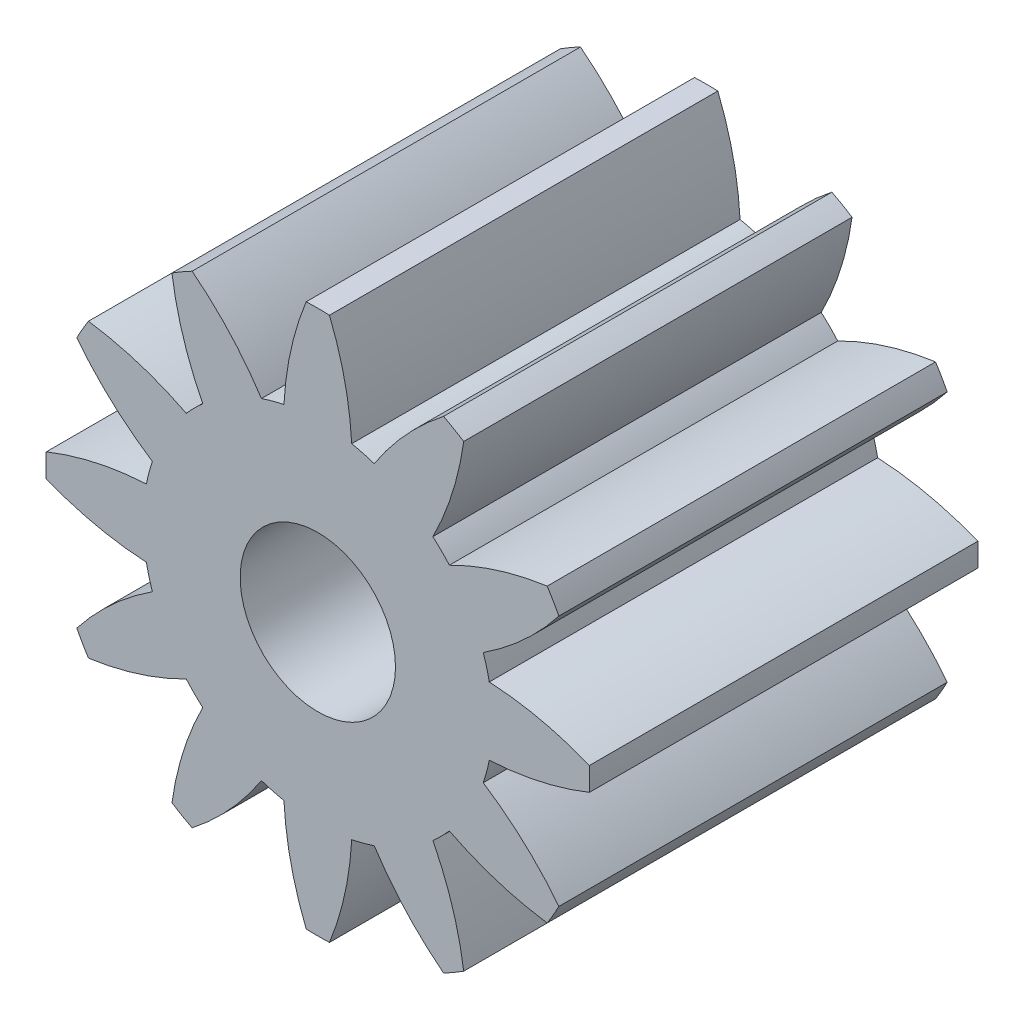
ISO-10303-21;
HEADER;
FILE_DESCRIPTION(('STEP AP214'),'2;1');
FILE_NAME('part.step','',(''),(''),'','','');
FILE_SCHEMA(('AUTOMOTIVE_DESIGN { 1 0 10303 214 1 1 1 1 }'));
ENDSEC;
DATA;
#1=APPLICATION_CONTEXT('core data for automotive mechanical design processes');
#2=APPLICATION_PROTOCOL_DEFINITION('international standard','automotive_design',2000,#1);
#3=PRODUCT_CONTEXT('',#1,'mechanical');
#4=PRODUCT('Part','Part','',(#3));
#5=PRODUCT_RELATED_PRODUCT_CATEGORY('part','',(#4));
#6=PRODUCT_DEFINITION_FORMATION('','',#4);
#7=PRODUCT_DEFINITION_CONTEXT('part definition',#1,'design');
#8=PRODUCT_DEFINITION('design','',#6,#7);
#9=PRODUCT_DEFINITION_SHAPE('','',#8);
#10=(LENGTH_UNIT() NAMED_UNIT(*) SI_UNIT(.MILLI.,.METRE.));
#11=(NAMED_UNIT(*) PLANE_ANGLE_UNIT() SI_UNIT($,.RADIAN.));
#12=(NAMED_UNIT(*) SI_UNIT($,.STERADIAN.) SOLID_ANGLE_UNIT());
#13=UNCERTAINTY_MEASURE_WITH_UNIT(LENGTH_MEASURE(1.E-05),#10,'distance_accuracy_value','');
#14=(GEOMETRIC_REPRESENTATION_CONTEXT(3) GLOBAL_UNCERTAINTY_ASSIGNED_CONTEXT((#13)) GLOBAL_UNIT_ASSIGNED_CONTEXT((#10,
#11,#12)) REPRESENTATION_CONTEXT('',''));
#15=CARTESIAN_POINT('',(0.,0.,0.));
#16=DIRECTION('',(0.,0.,1.));
#17=DIRECTION('',(1.,0.,0.));
#18=AXIS2_PLACEMENT_3D('',#15,#16,#17);
#19=CARTESIAN_POINT('',(0.,0.,5.));
#20=DIRECTION('',(0.,0.,-1.));
#21=DIRECTION('',(-1.,0.,0.));
#22=AXIS2_PLACEMENT_3D('',#19,#20,#21);
#23=CYLINDRICAL_SURFACE('',#22,3.5);
#24=CARTESIAN_POINT('',(0.,0.,5.));
#25=DIRECTION('',(0.,0.,1.));
#26=DIRECTION('',(1.,0.,0.));
#27=AXIS2_PLACEMENT_3D('',#24,#25,#26);
#28=CIRCLE('',#27,3.5);
#29=CARTESIAN_POINT('',(1.87829592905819,2.95330398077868,5.));
#30=VERTEX_POINT('',#29);
#31=CARTESIAN_POINT('',(1.61848830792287,3.10330398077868,5.));
#32=VERTEX_POINT('',#31);
#33=EDGE_CURVE('E34',#30,#32,#28,.T.);
#34=ORIENTED_EDGE('',*,*,#33,.F.);
#35=DIRECTION('',(0.,0.,1.));
#36=VECTOR('',#35,1.);
#37=CARTESIAN_POINT('',(1.87829592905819,2.95330398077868,0.));
#38=LINE('',#37,#36);
#39=CARTESIAN_POINT('',(1.87829592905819,2.95330398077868,0.));
#40=VERTEX_POINT('',#39);
#41=EDGE_CURVE('E624',#40,#30,#38,.T.);
#42=ORIENTED_EDGE('',*,*,#41,.F.);
#43=CARTESIAN_POINT('',(0.,0.,0.));
#44=DIRECTION('',(0.,0.,1.));
#45=DIRECTION('',(1.,0.,0.));
#46=AXIS2_PLACEMENT_3D('',#43,#44,#45);
#47=CIRCLE('',#46,3.5);
#48=CARTESIAN_POINT('',(1.61848830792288,3.10330398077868,0.));
#49=VERTEX_POINT('',#48);
#50=EDGE_CURVE('E661',#40,#49,#47,.T.);
#51=ORIENTED_EDGE('',*,*,#50,.T.);
#52=DIRECTION('',(0.,0.,1.));
#53=VECTOR('',#52,1.);
#54=CARTESIAN_POINT('',(1.61848830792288,3.10330398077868,0.));
#55=LINE('',#54,#53);
#56=EDGE_CURVE('E627',#49,#32,#55,.T.);
#57=ORIENTED_EDGE('',*,*,#56,.T.);
#58=EDGE_LOOP('',(#34,#42,#51,#57));
#59=FACE_BOUND('',#58,.T.);
#60=ADVANCED_FACE('F30',(#59),#23,.T.);
#61=CARTESIAN_POINT('',(3.10330398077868,1.61848830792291,5.));
#62=VERTEX_POINT('',#61);
#63=CARTESIAN_POINT('',(2.95330398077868,1.87829592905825,5.));
#64=VERTEX_POINT('',#63);
#65=EDGE_CURVE('E676',#62,#64,#28,.T.);
#66=ORIENTED_EDGE('',*,*,#65,.F.);
#67=DIRECTION('',(0.,0.,1.));
#68=VECTOR('',#67,1.);
#69=CARTESIAN_POINT('',(3.10330398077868,1.61848830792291,0.));
#70=LINE('',#69,#68);
#71=CARTESIAN_POINT('',(3.10330398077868,1.61848830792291,0.));
#72=VERTEX_POINT('',#71);
#73=EDGE_CURVE('E600',#72,#62,#70,.T.);
#74=ORIENTED_EDGE('',*,*,#73,.F.);
#75=CARTESIAN_POINT('',(2.95330398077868,1.87829592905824,0.));
#76=VERTEX_POINT('',#75);
#77=EDGE_CURVE('E663',#72,#76,#47,.T.);
#78=ORIENTED_EDGE('',*,*,#77,.T.);
#79=DIRECTION('',(0.,0.,1.));
#80=VECTOR('',#79,1.);
#81=CARTESIAN_POINT('',(2.95330398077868,1.87829592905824,0.));
#82=LINE('',#81,#80);
#83=EDGE_CURVE('E603',#76,#64,#82,.T.);
#84=ORIENTED_EDGE('',*,*,#83,.T.);
#85=EDGE_LOOP('',(#66,#74,#78,#84));
#86=FACE_BOUND('',#85,.T.);
#87=ADVANCED_FACE('F742',(#86),#23,.T.);
#88=CARTESIAN_POINT('',(3.49678423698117,-0.150000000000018,5.));
#89=VERTEX_POINT('',#88);
#90=CARTESIAN_POINT('',(3.49678423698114,0.149999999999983,5.));
#91=VERTEX_POINT('',#90);
#92=EDGE_CURVE('E732',#89,#91,#28,.T.);
#93=ORIENTED_EDGE('',*,*,#92,.F.);
#94=DIRECTION('',(0.,0.,1.));
#95=VECTOR('',#94,1.);
#96=CARTESIAN_POINT('',(3.49678423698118,-0.150000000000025,0.));
#97=LINE('',#96,#95);
#98=CARTESIAN_POINT('',(3.49678423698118,-0.150000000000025,0.));
#99=VERTEX_POINT('',#98);
#100=EDGE_CURVE('E577',#99,#89,#97,.T.);
#101=ORIENTED_EDGE('',*,*,#100,.F.);
#102=CARTESIAN_POINT('',(3.49678423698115,0.149999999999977,0.));
#103=VERTEX_POINT('',#102);
#104=EDGE_CURVE('E669',#99,#103,#47,.T.);
#105=ORIENTED_EDGE('',*,*,#104,.T.);
#106=DIRECTION('',(0.,0.,1.));
#107=VECTOR('',#106,1.);
#108=CARTESIAN_POINT('',(3.49678423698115,0.149999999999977,0.));
#109=LINE('',#108,#107);
#110=EDGE_CURVE('E580',#103,#91,#109,.T.);
#111=ORIENTED_EDGE('',*,*,#110,.T.);
#112=EDGE_LOOP('',(#93,#101,#105,#111));
#113=FACE_BOUND('',#112,.T.);
#114=ADVANCED_FACE('F720',(#113),#23,.T.);
#115=CARTESIAN_POINT('',(2.95330398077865,-1.87829592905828,5.));
#116=VERTEX_POINT('',#115);
#117=CARTESIAN_POINT('',(3.10330398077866,-1.61848830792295,5.));
#118=VERTEX_POINT('',#117);
#119=EDGE_CURVE('E734',#116,#118,#28,.T.);
#120=ORIENTED_EDGE('',*,*,#119,.F.);
#121=DIRECTION('',(0.,0.,1.));
#122=VECTOR('',#121,1.);
#123=CARTESIAN_POINT('',(2.95330398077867,-1.87829592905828,0.));
#124=LINE('',#123,#122);
#125=CARTESIAN_POINT('',(2.95330398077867,-1.87829592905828,0.));
#126=VERTEX_POINT('',#125);
#127=EDGE_CURVE('E552',#126,#116,#124,.T.);
#128=ORIENTED_EDGE('',*,*,#127,.F.);
#129=CARTESIAN_POINT('',(3.10330398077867,-1.61848830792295,0.));
#130=VERTEX_POINT('',#129);
#131=EDGE_CURVE('E707',#126,#130,#47,.T.);
#132=ORIENTED_EDGE('',*,*,#131,.T.);
#133=DIRECTION('',(0.,0.,1.));
#134=VECTOR('',#133,1.);
#135=CARTESIAN_POINT('',(3.10330398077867,-1.61848830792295,0.));
#136=LINE('',#135,#134);
#137=EDGE_CURVE('E555',#130,#118,#136,.T.);
#138=ORIENTED_EDGE('',*,*,#137,.T.);
#139=EDGE_LOOP('',(#120,#128,#132,#138));
#140=FACE_BOUND('',#139,.T.);
#141=ADVANCED_FACE('F810',(#140),#23,.T.);
#142=CARTESIAN_POINT('',(1.61848830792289,-3.1033039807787,5.));
#143=VERTEX_POINT('',#142);
#144=CARTESIAN_POINT('',(1.87829592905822,-2.9533039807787,5.));
#145=VERTEX_POINT('',#144);
#146=EDGE_CURVE('E736',#143,#145,#28,.T.);
#147=ORIENTED_EDGE('',*,*,#146,.F.);
#148=DIRECTION('',(0.,0.,1.));
#149=VECTOR('',#148,1.);
#150=CARTESIAN_POINT('',(1.61848830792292,-3.1033039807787,0.));
#151=LINE('',#150,#149);
#152=CARTESIAN_POINT('',(1.61848830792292,-3.1033039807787,0.));
#153=VERTEX_POINT('',#152);
#154=EDGE_CURVE('E526',#153,#143,#151,.T.);
#155=ORIENTED_EDGE('',*,*,#154,.F.);
#156=CARTESIAN_POINT('',(1.87829592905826,-2.95330398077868,0.));
#157=VERTEX_POINT('',#156);
#158=EDGE_CURVE('E702',#153,#157,#47,.T.);
#159=ORIENTED_EDGE('',*,*,#158,.T.);
#160=DIRECTION('',(0.,0.,1.));
#161=VECTOR('',#160,1.);
#162=CARTESIAN_POINT('',(1.87829592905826,-2.95330398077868,0.));
#163=LINE('',#162,#161);
#164=EDGE_CURVE('E529',#157,#145,#163,.T.);
#165=ORIENTED_EDGE('',*,*,#164,.T.);
#166=EDGE_LOOP('',(#147,#155,#159,#165));
#167=FACE_BOUND('',#166,.T.);
#168=ADVANCED_FACE('F799',(#167),#23,.T.);
#169=CARTESIAN_POINT('',(-0.150000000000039,-3.49678423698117,5.));
#170=VERTEX_POINT('',#169);
#171=CARTESIAN_POINT('',(0.149999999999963,-3.49678423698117,5.));
#172=VERTEX_POINT('',#171);
#173=EDGE_CURVE('E785',#170,#172,#28,.T.);
#174=ORIENTED_EDGE('',*,*,#173,.F.);
#175=DIRECTION('',(0.,0.,1.));
#176=VECTOR('',#175,1.);
#177=CARTESIAN_POINT('',(-0.150000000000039,-3.49678423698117,0.));
#178=LINE('',#177,#176);
#179=CARTESIAN_POINT('',(-0.150000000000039,-3.49678423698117,0.));
#180=VERTEX_POINT('',#179);
#181=EDGE_CURVE('E500',#180,#170,#178,.T.);
#182=ORIENTED_EDGE('',*,*,#181,.F.);
#183=CARTESIAN_POINT('',(0.14999999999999,-3.49678423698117,0.));
#184=VERTEX_POINT('',#183);
#185=EDGE_CURVE('E697',#180,#184,#47,.T.);
#186=ORIENTED_EDGE('',*,*,#185,.T.);
#187=DIRECTION('',(0.,0.,1.));
#188=VECTOR('',#187,1.);
#189=CARTESIAN_POINT('',(0.14999999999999,-3.49678423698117,0.));
#190=LINE('',#189,#188);
#191=EDGE_CURVE('E503',#184,#172,#190,.T.);
#192=ORIENTED_EDGE('',*,*,#191,.T.);
#193=EDGE_LOOP('',(#174,#182,#186,#192));
#194=FACE_BOUND('',#193,.T.);
#195=ADVANCED_FACE('F886',(#194),#23,.T.);
#196=CARTESIAN_POINT('',(-1.87829592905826,-2.95330398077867,5.00000000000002));
#197=VERTEX_POINT('',#196);
#198=CARTESIAN_POINT('',(-1.61848830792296,-3.10330398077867,5.));
#199=VERTEX_POINT('',#198);
#200=EDGE_CURVE('E780',#197,#199,#28,.T.);
#201=ORIENTED_EDGE('',*,*,#200,.F.);
#202=DIRECTION('',(0.,0.,1.));
#203=VECTOR('',#202,1.);
#204=CARTESIAN_POINT('',(-1.87829592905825,-2.95330398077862,0.));
#205=LINE('',#204,#203);
#206=CARTESIAN_POINT('',(-1.87829592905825,-2.95330398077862,0.));
#207=VERTEX_POINT('',#206);
#208=EDGE_CURVE('E474',#207,#197,#205,.T.);
#209=ORIENTED_EDGE('',*,*,#208,.F.);
#210=CARTESIAN_POINT('',(-1.61848830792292,-3.10330398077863,0.));
#211=VERTEX_POINT('',#210);
#212=EDGE_CURVE('E692',#207,#211,#47,.T.);
#213=ORIENTED_EDGE('',*,*,#212,.T.);
#214=DIRECTION('',(0.,0.,1.));
#215=VECTOR('',#214,1.);
#216=CARTESIAN_POINT('',(-1.61848830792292,-3.10330398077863,0.));
#217=LINE('',#216,#215);
#218=EDGE_CURVE('E477',#211,#199,#217,.T.);
#219=ORIENTED_EDGE('',*,*,#218,.T.);
#220=EDGE_LOOP('',(#201,#209,#213,#219));
#221=FACE_BOUND('',#220,.T.);
#222=ADVANCED_FACE('F877',(#221),#23,.T.);
#223=CARTESIAN_POINT('',(-3.10330398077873,-1.61848830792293,5.));
#224=VERTEX_POINT('',#223);
#225=CARTESIAN_POINT('',(-2.95330398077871,-1.87829592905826,5.));
#226=VERTEX_POINT('',#225);
#227=EDGE_CURVE('E775',#224,#226,#28,.T.);
#228=ORIENTED_EDGE('',*,*,#227,.F.);
#229=DIRECTION('',(0.,0.,1.));
#230=VECTOR('',#229,1.);
#231=CARTESIAN_POINT('',(-3.10330398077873,-1.61848830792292,0.));
#232=LINE('',#231,#230);
#233=CARTESIAN_POINT('',(-3.10330398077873,-1.61848830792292,0.));
#234=VERTEX_POINT('',#233);
#235=EDGE_CURVE('E448',#234,#224,#232,.T.);
#236=ORIENTED_EDGE('',*,*,#235,.F.);
#237=CARTESIAN_POINT('',(-2.9533039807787,-1.87829592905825,0.));
#238=VERTEX_POINT('',#237);
#239=EDGE_CURVE('E687',#234,#238,#47,.T.);
#240=ORIENTED_EDGE('',*,*,#239,.T.);
#241=DIRECTION('',(0.,0.,1.));
#242=VECTOR('',#241,1.);
#243=CARTESIAN_POINT('',(-2.9533039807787,-1.87829592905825,0.));
#244=LINE('',#243,#242);
#245=EDGE_CURVE('E451',#238,#226,#244,.T.);
#246=ORIENTED_EDGE('',*,*,#245,.T.);
#247=EDGE_LOOP('',(#228,#236,#240,#246));
#248=FACE_BOUND('',#247,.T.);
#249=ADVANCED_FACE('F852',(#248),#23,.T.);
#250=CARTESIAN_POINT('',(-3.49678423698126,0.150000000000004,5.));
#251=VERTEX_POINT('',#250);
#252=CARTESIAN_POINT('',(-3.49678423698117,-0.14999999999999,5.));
#253=VERTEX_POINT('',#252);
#254=EDGE_CURVE('E770',#251,#253,#28,.T.);
#255=ORIENTED_EDGE('',*,*,#254,.F.);
#256=DIRECTION('',(0.,0.,1.));
#257=VECTOR('',#256,1.);
#258=CARTESIAN_POINT('',(-3.49678423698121,0.150000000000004,0.));
#259=LINE('',#258,#257);
#260=CARTESIAN_POINT('',(-3.49678423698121,0.150000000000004,0.));
#261=VERTEX_POINT('',#260);
#262=EDGE_CURVE('E422',#261,#251,#259,.T.);
#263=ORIENTED_EDGE('',*,*,#262,.F.);
#264=CARTESIAN_POINT('',(-3.49678423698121,-0.149999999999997,0.));
#265=VERTEX_POINT('',#264);
#266=EDGE_CURVE('E682',#261,#265,#47,.T.);
#267=ORIENTED_EDGE('',*,*,#266,.T.);
#268=DIRECTION('',(0.,0.,1.));
#269=VECTOR('',#268,1.);
#270=CARTESIAN_POINT('',(-3.49678423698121,-0.149999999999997,0.));
#271=LINE('',#270,#269);
#272=EDGE_CURVE('E425',#265,#253,#271,.T.);
#273=ORIENTED_EDGE('',*,*,#272,.T.);
#274=EDGE_LOOP('',(#255,#263,#267,#273));
#275=FACE_BOUND('',#274,.T.);
#276=ADVANCED_FACE('F848',(#275),#23,.T.);
#277=CARTESIAN_POINT('',(-2.95330398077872,1.87829592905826,5.00000000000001));
#278=VERTEX_POINT('',#277);
#279=CARTESIAN_POINT('',(-3.10330398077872,1.61848830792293,5.00000000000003));
#280=VERTEX_POINT('',#279);
#281=EDGE_CURVE('E768',#278,#280,#28,.T.);
#282=ORIENTED_EDGE('',*,*,#281,.F.);
#283=DIRECTION('',(0.,0.,1.));
#284=VECTOR('',#283,1.);
#285=CARTESIAN_POINT('',(-2.95330398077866,1.87829592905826,0.));
#286=LINE('',#285,#284);
#287=CARTESIAN_POINT('',(-2.95330398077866,1.87829592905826,0.));
#288=VERTEX_POINT('',#287);
#289=EDGE_CURVE('E396',#288,#278,#286,.T.);
#290=ORIENTED_EDGE('',*,*,#289,.F.);
#291=CARTESIAN_POINT('',(-3.10330398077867,1.61848830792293,0.));
#292=VERTEX_POINT('',#291);
#293=EDGE_CURVE('E678',#288,#292,#47,.T.);
#294=ORIENTED_EDGE('',*,*,#293,.T.);
#295=DIRECTION('',(0.,0.,1.));
#296=VECTOR('',#295,1.);
#297=CARTESIAN_POINT('',(-3.10330398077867,1.61848830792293,0.));
#298=LINE('',#297,#296);
#299=EDGE_CURVE('E399',#292,#280,#298,.T.);
#300=ORIENTED_EDGE('',*,*,#299,.T.);
#301=EDGE_LOOP('',(#282,#290,#294,#300));
#302=FACE_BOUND('',#301,.T.);
#303=ADVANCED_FACE('F843',(#302),#23,.T.);
#304=CARTESIAN_POINT('',(0.149999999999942,3.49678423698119,5.00000000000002));
#305=VERTEX_POINT('',#304);
#306=CARTESIAN_POINT('',(-0.150000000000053,3.49678423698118,5.00000000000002));
#307=VERTEX_POINT('',#306);
#308=EDGE_CURVE('E11',#305,#307,#28,.T.);
#309=ORIENTED_EDGE('',*,*,#308,.F.);
#310=DIRECTION('',(0.,0.,1.));
#311=VECTOR('',#310,1.);
#312=CARTESIAN_POINT('',(0.14999999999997,3.49678423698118,0.));
#313=LINE('',#312,#311);
#314=CARTESIAN_POINT('',(0.14999999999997,3.49678423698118,0.));
#315=VERTEX_POINT('',#314);
#316=EDGE_CURVE('E648',#315,#305,#313,.T.);
#317=ORIENTED_EDGE('',*,*,#316,.F.);
#318=CARTESIAN_POINT('',(-0.150000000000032,3.49678423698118,0.));
#319=VERTEX_POINT('',#318);
#320=EDGE_CURVE('E664',#315,#319,#47,.T.);
#321=ORIENTED_EDGE('',*,*,#320,.T.);
#322=DIRECTION('',(0.,0.,1.));
#323=VECTOR('',#322,1.);
#324=CARTESIAN_POINT('',(-0.150000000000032,3.49678423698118,0.));
#325=LINE('',#324,#323);
#326=EDGE_CURVE('E651',#319,#307,#325,.T.);
#327=ORIENTED_EDGE('',*,*,#326,.T.);
#328=EDGE_LOOP('',(#309,#317,#321,#327));
#329=FACE_BOUND('',#328,.T.);
#330=ADVANCED_FACE('F763',(#329),#23,.T.);
#331=CARTESIAN_POINT('',(0.,0.,5.));
#332=DIRECTION('',(0.,0.,1.));
#333=DIRECTION('',(1.,0.,0.));
#334=AXIS2_PLACEMENT_3D('',#331,#332,#333);
#335=PLANE('',#334);
#336=CARTESIAN_POINT('',(4.08027441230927,-0.0494105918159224,5.));
#337=DIRECTION('',(0.,0.,-1.));
#338=DIRECTION('',(0.866025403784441,-0.500000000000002,0.));
#339=AXIS2_PLACEMENT_3D('',#336,#337,#338);
#340=CIRCLE('',#339,4.);
#341=CARTESIAN_POINT('',(0.725936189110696,2.12967524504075,5.));
#342=VERTEX_POINT('',#341);
#343=EDGE_CURVE('E612',#342,#32,#340,.T.);
#344=ORIENTED_EDGE('',*,*,#343,.F.);
#345=CARTESIAN_POINT('',(0.,0.,5.));
#346=DIRECTION('',(0.,0.,-1.));
#347=DIRECTION('',(-1.,0.,0.));
#348=AXIS2_PLACEMENT_3D('',#345,#346,#347);
#349=CIRCLE('',#348,2.25);
#350=CARTESIAN_POINT('',(0.436158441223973,2.20732095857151,5.));
#351=VERTEX_POINT('',#350);
#352=EDGE_CURVE('E350',#351,#342,#349,.T.);
#353=ORIENTED_EDGE('',*,*,#352,.F.);
#354=CARTESIAN_POINT('',(-3.55832659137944,1.99734637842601,5.));
#355=DIRECTION('',(0.,0.,-1.));
#356=DIRECTION('',(-1.,0.,0.));
#357=AXIS2_PLACEMENT_3D('',#354,#355,#356);
#358=CIRCLE('',#357,4.);
#359=EDGE_CURVE('E626',#305,#351,#358,.T.);
#360=ORIENTED_EDGE('',*,*,#359,.F.);
#361=ORIENTED_EDGE('',*,*,#308,.T.);
#362=CARTESIAN_POINT('',(3.5583265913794,1.99734637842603,5.));
#363=DIRECTION('',(0.,0.,-1.));
#364=DIRECTION('',(1.,0.,0.));
#365=AXIS2_PLACEMENT_3D('',#362,#363,#364);
#366=CIRCLE('',#365,4.);
#367=CARTESIAN_POINT('',(-0.436158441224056,2.20732095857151,5.));
#368=VERTEX_POINT('',#367);
#369=EDGE_CURVE('E348',#368,#307,#366,.T.);
#370=ORIENTED_EDGE('',*,*,#369,.F.);
#371=CARTESIAN_POINT('',(0.,0.,5.));
#372=DIRECTION('',(0.,0.,-1.));
#373=DIRECTION('',(1.,0.,0.));
#374=AXIS2_PLACEMENT_3D('',#371,#372,#373);
#375=CIRCLE('',#374,2.25);
#376=CARTESIAN_POINT('',(-0.725936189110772,2.12967524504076,5.));
#377=VERTEX_POINT('',#376);
#378=EDGE_CURVE('E339',#377,#368,#375,.T.);
#379=ORIENTED_EDGE('',*,*,#378,.F.);
#380=CARTESIAN_POINT('',(-4.08027441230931,-0.0494105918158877,5.));
#381=DIRECTION('',(0.,0.,-1.));
#382=DIRECTION('',(-0.866025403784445,-0.499999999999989,0.));
#383=AXIS2_PLACEMENT_3D('',#380,#381,#382);
#384=CIRCLE('',#383,4.);
#385=CARTESIAN_POINT('',(-1.61848830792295,3.10330398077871,5.));
#386=VERTEX_POINT('',#385);
#387=EDGE_CURVE('E346',#386,#377,#384,.T.);
#388=ORIENTED_EDGE('',*,*,#387,.F.);
#389=CARTESIAN_POINT('',(-1.87829592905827,2.95330398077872,5.));
#390=VERTEX_POINT('',#389);
#391=EDGE_CURVE('E39',#386,#390,#28,.T.);
#392=ORIENTED_EDGE('',*,*,#391,.T.);
#393=CARTESIAN_POINT('',(2.08292803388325,3.50891599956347,5.00000000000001));
#394=DIRECTION('',(0.,0.,-1.));
#395=DIRECTION('',(0.866025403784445,0.499999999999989,0.));
#396=AXIS2_PLACEMENT_3D('',#393,#394,#395);
#397=CIRCLE('',#396,4.);
#398=CARTESIAN_POINT('',(-1.4813847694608,1.69351680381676,5.));
#399=VERTEX_POINT('',#398);
#400=EDGE_CURVE('E365',#399,#390,#397,.T.);
#401=ORIENTED_EDGE('',*,*,#400,.F.);
#402=CARTESIAN_POINT('',(0.,0.,5.));
#403=DIRECTION('',(0.,0.,-1.));
#404=DIRECTION('',(-0.50000000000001,-0.866025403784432,0.));
#405=AXIS2_PLACEMENT_3D('',#402,#403,#404);
#406=CIRCLE('',#405,2.25);
#407=CARTESIAN_POINT('',(-1.69351680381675,1.4813847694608,5.));
#408=VERTEX_POINT('',#407);
#409=EDGE_CURVE('E382',#408,#399,#406,.T.);
#410=ORIENTED_EDGE('',*,*,#409,.F.);
#411=CARTESIAN_POINT('',(-3.50891599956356,-2.0829280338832,5.));
#412=DIRECTION('',(0.,0.,-1.));
#413=DIRECTION('',(-0.50000000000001,-0.866025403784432,0.));
#414=AXIS2_PLACEMENT_3D('',#411,#412,#413);
#415=CIRCLE('',#414,4.);
#416=EDGE_CURVE('E374',#278,#408,#415,.T.);
#417=ORIENTED_EDGE('',*,*,#416,.F.);
#418=ORIENTED_EDGE('',*,*,#281,.T.);
#419=CARTESIAN_POINT('',(0.0494105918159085,4.08027441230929,5.));
#420=DIRECTION('',(0.,0.,-1.));
#421=DIRECTION('',(0.50000000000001,0.866025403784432,0.));
#422=AXIS2_PLACEMENT_3D('',#419,#420,#421);
#423=CIRCLE('',#422,4.);
#424=CARTESIAN_POINT('',(-2.12967524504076,0.725936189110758,5.));
#425=VERTEX_POINT('',#424);
#426=EDGE_CURVE('E384',#425,#280,#423,.T.);
#427=ORIENTED_EDGE('',*,*,#426,.F.);
#428=CARTESIAN_POINT('',(0.,0.,5.));
#429=DIRECTION('',(0.,0.,-1.));
#430=DIRECTION('',(0.,-1.,0.));
#431=AXIS2_PLACEMENT_3D('',#428,#429,#430);
#432=CIRCLE('',#431,2.25);
#433=CARTESIAN_POINT('',(-2.20732095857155,0.436158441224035,5.));
#434=VERTEX_POINT('',#433);
#435=EDGE_CURVE('E408',#434,#425,#432,.T.);
#436=ORIENTED_EDGE('',*,*,#435,.F.);
#437=CARTESIAN_POINT('',(-1.99734637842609,-3.55832659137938,5.));
#438=DIRECTION('',(0.,0.,-1.));
#439=DIRECTION('',(0.,-1.,0.));
#440=AXIS2_PLACEMENT_3D('',#437,#438,#439);
#441=CIRCLE('',#440,4.);
#442=EDGE_CURVE('E398',#251,#434,#441,.T.);
#443=ORIENTED_EDGE('',*,*,#442,.F.);
#444=ORIENTED_EDGE('',*,*,#254,.T.);
#445=CARTESIAN_POINT('',(-1.99734637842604,3.55832659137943,5.));
#446=DIRECTION('',(0.,0.,-1.));
#447=DIRECTION('',(0.,1.,0.));
#448=AXIS2_PLACEMENT_3D('',#445,#446,#447);
#449=CIRCLE('',#448,4.);
#450=CARTESIAN_POINT('',(-2.2073209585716,-0.436158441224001,5.));
#451=VERTEX_POINT('',#450);
#452=EDGE_CURVE('E410',#451,#253,#449,.T.);
#453=ORIENTED_EDGE('',*,*,#452,.F.);
#454=CARTESIAN_POINT('',(0.,0.,5.));
#455=DIRECTION('',(0.,0.,-1.));
#456=DIRECTION('',(0.499999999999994,-0.866025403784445,0.));
#457=AXIS2_PLACEMENT_3D('',#454,#455,#456);
#458=CIRCLE('',#457,2.25);
#459=CARTESIAN_POINT('',(-2.1296752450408,-0.725936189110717,5.));
#460=VERTEX_POINT('',#459);
#461=EDGE_CURVE('E434',#460,#451,#458,.T.);
#462=ORIENTED_EDGE('',*,*,#461,.F.);
#463=CARTESIAN_POINT('',(0.049410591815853,-4.08027441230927,5.));
#464=DIRECTION('',(0.,0.,-1.));
#465=DIRECTION('',(0.499999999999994,-0.866025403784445,0.));
#466=AXIS2_PLACEMENT_3D('',#463,#464,#465);
#467=CIRCLE('',#466,4.);
#468=EDGE_CURVE('E424',#224,#460,#467,.T.);
#469=ORIENTED_EDGE('',*,*,#468,.F.);
#470=ORIENTED_EDGE('',*,*,#227,.T.);
#471=CARTESIAN_POINT('',(-3.50891599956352,2.08292803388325,5.));
#472=DIRECTION('',(0.,0.,-1.));
#473=DIRECTION('',(-0.499999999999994,0.866025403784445,0.));
#474=AXIS2_PLACEMENT_3D('',#471,#472,#473);
#475=CIRCLE('',#474,4.);
#476=CARTESIAN_POINT('',(-1.69351680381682,-1.48138476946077,5.));
#477=VERTEX_POINT('',#476);
#478=EDGE_CURVE('E436',#477,#226,#475,.T.);
#479=ORIENTED_EDGE('',*,*,#478,.F.);
#480=CARTESIAN_POINT('',(0.,0.,5.));
#481=DIRECTION('',(0.,0.,-1.));
#482=DIRECTION('',(0.866025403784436,-0.500000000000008,0.));
#483=AXIS2_PLACEMENT_3D('',#480,#481,#482);
#484=CIRCLE('',#483,2.25);
#485=CARTESIAN_POINT('',(-1.48138476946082,-1.69351680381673,5.));
#486=VERTEX_POINT('',#485);
#487=EDGE_CURVE('E460',#486,#477,#484,.T.);
#488=ORIENTED_EDGE('',*,*,#487,.F.);
#489=CARTESIAN_POINT('',(2.08292803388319,-3.50891599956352,5.));
#490=DIRECTION('',(0.,0.,-1.));
#491=DIRECTION('',(0.866025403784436,-0.500000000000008,0.));
#492=AXIS2_PLACEMENT_3D('',#489,#490,#491);
#493=CIRCLE('',#492,4.);
#494=EDGE_CURVE('E450',#197,#486,#493,.T.);
#495=ORIENTED_EDGE('',*,*,#494,.F.);
#496=ORIENTED_EDGE('',*,*,#200,.T.);
#497=CARTESIAN_POINT('',(-4.08027441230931,0.0494105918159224,5.));
#498=DIRECTION('',(0.,0.,-1.));
#499=DIRECTION('',(-0.866025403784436,0.500000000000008,0.));
#500=AXIS2_PLACEMENT_3D('',#497,#498,#499);
#501=CIRCLE('',#500,4.);
#502=CARTESIAN_POINT('',(-0.725936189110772,-2.12967524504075,5.));
#503=VERTEX_POINT('',#502);
#504=EDGE_CURVE('E462',#503,#199,#501,.T.);
#505=ORIENTED_EDGE('',*,*,#504,.F.);
#506=CARTESIAN_POINT('',(0.,0.,5.));
#507=DIRECTION('',(0.,0.,-1.));
#508=DIRECTION('',(1.,0.,0.));
#509=AXIS2_PLACEMENT_3D('',#506,#507,#508);
#510=CIRCLE('',#509,2.25);
#511=CARTESIAN_POINT('',(-0.436158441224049,-2.20732095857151,5.));
#512=VERTEX_POINT('',#511);
#513=EDGE_CURVE('E486',#512,#503,#510,.T.);
#514=ORIENTED_EDGE('',*,*,#513,.F.);
#515=CARTESIAN_POINT('',(3.55832659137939,-1.99734637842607,5.));
#516=DIRECTION('',(0.,0.,-1.));
#517=DIRECTION('',(1.,0.,0.));
#518=AXIS2_PLACEMENT_3D('',#515,#516,#517);
#519=CIRCLE('',#518,4.);
#520=EDGE_CURVE('E476',#170,#512,#519,.T.);
#521=ORIENTED_EDGE('',*,*,#520,.F.);
#522=ORIENTED_EDGE('',*,*,#173,.T.);
#523=CARTESIAN_POINT('',(-3.5583265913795,-1.99734637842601,5.));
#524=DIRECTION('',(0.,0.,-1.));
#525=DIRECTION('',(-1.,0.,0.));
#526=AXIS2_PLACEMENT_3D('',#523,#524,#525);
#527=CIRCLE('',#526,4.);
#528=CARTESIAN_POINT('',(0.436158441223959,-2.20732095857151,5.));
#529=VERTEX_POINT('',#528);
#530=EDGE_CURVE('E488',#529,#172,#527,.T.);
#531=ORIENTED_EDGE('',*,*,#530,.F.);
#532=CARTESIAN_POINT('',(0.,0.,5.));
#533=DIRECTION('',(0.,0.,-1.));
#534=DIRECTION('',(0.866025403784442,0.499999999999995,0.));
#535=AXIS2_PLACEMENT_3D('',#532,#533,#534);
#536=CIRCLE('',#535,2.25);
#537=CARTESIAN_POINT('',(0.725936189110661,-2.12967524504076,5.));
#538=VERTEX_POINT('',#537);
#539=EDGE_CURVE('E512',#538,#529,#536,.T.);
#540=ORIENTED_EDGE('',*,*,#539,.F.);
#541=CARTESIAN_POINT('',(4.08027441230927,0.0494105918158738,5.));
#542=DIRECTION('',(0.,0.,-1.));
#543=DIRECTION('',(0.866025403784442,0.499999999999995,0.));
#544=AXIS2_PLACEMENT_3D('',#541,#542,#543);
#545=CIRCLE('',#544,4.);
#546=EDGE_CURVE('E502',#143,#538,#545,.T.);
#547=ORIENTED_EDGE('',*,*,#546,.F.);
#548=ORIENTED_EDGE('',*,*,#146,.T.);
#549=CARTESIAN_POINT('',(-2.08292803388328,-3.50891599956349,5.));
#550=DIRECTION('',(0.,0.,-1.));
#551=DIRECTION('',(-0.866025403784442,-0.499999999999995,0.));
#552=AXIS2_PLACEMENT_3D('',#549,#550,#551);
#553=CIRCLE('',#552,4.);
#554=CARTESIAN_POINT('',(1.48138476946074,-1.69351680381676,5.));
#555=VERTEX_POINT('',#554);
#556=EDGE_CURVE('E514',#555,#145,#553,.T.);
#557=ORIENTED_EDGE('',*,*,#556,.F.);
#558=CARTESIAN_POINT('',(0.,0.,5.));
#559=DIRECTION('',(0.,0.,-1.));
#560=DIRECTION('',(0.500000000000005,0.866025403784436,0.));
#561=AXIS2_PLACEMENT_3D('',#558,#559,#560);
#562=CIRCLE('',#561,2.25);
#563=CARTESIAN_POINT('',(1.69351680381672,-1.48138476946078,5.));
#564=VERTEX_POINT('',#563);
#565=EDGE_CURVE('E538',#564,#555,#562,.T.);
#566=ORIENTED_EDGE('',*,*,#565,.F.);
#567=CARTESIAN_POINT('',(3.50891599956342,2.08292803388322,5.));
#568=DIRECTION('',(0.,0.,-1.));
#569=DIRECTION('',(0.500000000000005,0.866025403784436,0.));
#570=AXIS2_PLACEMENT_3D('',#567,#568,#569);
#571=CIRCLE('',#570,4.);
#572=EDGE_CURVE('E528',#116,#564,#571,.T.);
#573=ORIENTED_EDGE('',*,*,#572,.F.);
#574=ORIENTED_EDGE('',*,*,#119,.T.);
#575=CARTESIAN_POINT('',(-0.0494105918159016,-4.08027441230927,5.));
#576=DIRECTION('',(0.,0.,-1.));
#577=DIRECTION('',(-0.500000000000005,-0.866025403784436,0.));
#578=AXIS2_PLACEMENT_3D('',#575,#576,#577);
#579=CIRCLE('',#578,4.);
#580=CARTESIAN_POINT('',(2.12967524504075,-0.725936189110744,5.00000000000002));
#581=VERTEX_POINT('',#580);
#582=EDGE_CURVE('E540',#581,#118,#579,.T.);
#583=ORIENTED_EDGE('',*,*,#582,.F.);
#584=CARTESIAN_POINT('',(0.,0.,5.));
#585=DIRECTION('',(0.,0.,-1.));
#586=DIRECTION('',(0.,1.,0.));
#587=AXIS2_PLACEMENT_3D('',#584,#585,#586);
#588=CIRCLE('',#587,2.25);
#589=CARTESIAN_POINT('',(2.20732095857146,-0.436158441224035,5.00000000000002));
#590=VERTEX_POINT('',#589);
#591=EDGE_CURVE('E564',#590,#581,#588,.T.);
#592=ORIENTED_EDGE('',*,*,#591,.F.);
#593=CARTESIAN_POINT('',(1.99734637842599,3.5583265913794,5.00000000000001));
#594=DIRECTION('',(0.,0.,-1.));
#595=DIRECTION('',(0.,1.,0.));
#596=AXIS2_PLACEMENT_3D('',#593,#594,#595);
#597=CIRCLE('',#596,4.);
#598=EDGE_CURVE('E554',#89,#590,#597,.T.);
#599=ORIENTED_EDGE('',*,*,#598,.F.);
#600=ORIENTED_EDGE('',*,*,#92,.T.);
#601=CARTESIAN_POINT('',(1.997346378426,-3.55832659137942,5.));
#602=DIRECTION('',(0.,0.,-1.));
#603=DIRECTION('',(0.,-1.,0.));
#604=AXIS2_PLACEMENT_3D('',#601,#602,#603);
#605=CIRCLE('',#604,4.);
#606=CARTESIAN_POINT('',(2.20732095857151,0.436158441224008,5.));
#607=VERTEX_POINT('',#606);
#608=EDGE_CURVE('E54',#607,#91,#605,.T.);
#609=ORIENTED_EDGE('',*,*,#608,.F.);
#610=CARTESIAN_POINT('',(0.,0.,5.));
#611=DIRECTION('',(0.,0.,-1.));
#612=DIRECTION('',(-0.499999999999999,0.866025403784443,0.));
#613=AXIS2_PLACEMENT_3D('',#610,#611,#612);
#614=CIRCLE('',#613,2.25);
#615=CARTESIAN_POINT('',(2.12967524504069,0.725936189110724,5.));
#616=VERTEX_POINT('',#615);
#617=EDGE_CURVE('E587',#616,#607,#614,.T.);
#618=ORIENTED_EDGE('',*,*,#617,.F.);
#619=CARTESIAN_POINT('',(-0.0494105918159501,4.08027441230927,5.));
#620=DIRECTION('',(0.,0.,-1.));
#621=DIRECTION('',(-0.499999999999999,0.866025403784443,0.));
#622=AXIS2_PLACEMENT_3D('',#619,#620,#621);
#623=CIRCLE('',#622,4.);
#624=EDGE_CURVE('E579',#62,#616,#623,.T.);
#625=ORIENTED_EDGE('',*,*,#624,.F.);
#626=ORIENTED_EDGE('',*,*,#65,.T.);
#627=CARTESIAN_POINT('',(3.50891599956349,-2.08292803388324,5.));
#628=DIRECTION('',(0.,0.,-1.));
#629=DIRECTION('',(0.499999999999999,-0.866025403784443,0.));
#630=AXIS2_PLACEMENT_3D('',#627,#628,#629);
#631=CIRCLE('',#630,4.);
#632=CARTESIAN_POINT('',(1.69351680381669,1.48138476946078,5.));
#633=VERTEX_POINT('',#632);
#634=EDGE_CURVE('E46',#633,#64,#631,.T.);
#635=ORIENTED_EDGE('',*,*,#634,.F.);
#636=CARTESIAN_POINT('',(0.,0.,5.));
#637=DIRECTION('',(0.,0.,-1.));
#638=DIRECTION('',(-0.866025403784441,0.500000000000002,0.));
#639=AXIS2_PLACEMENT_3D('',#636,#637,#638);
#640=CIRCLE('',#639,2.25);
#641=CARTESIAN_POINT('',(1.48138476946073,1.69351680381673,5.));
#642=VERTEX_POINT('',#641);
#643=EDGE_CURVE('E610',#642,#633,#640,.T.);
#644=ORIENTED_EDGE('',*,*,#643,.F.);
#645=CARTESIAN_POINT('',(-2.08292803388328,3.5089159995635,5.));
#646=DIRECTION('',(0.,0.,-1.));
#647=DIRECTION('',(-0.866025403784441,0.500000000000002,0.));
#648=AXIS2_PLACEMENT_3D('',#645,#646,#647);
#649=CIRCLE('',#648,4.);
#650=EDGE_CURVE('E602',#30,#642,#649,.T.);
#651=ORIENTED_EDGE('',*,*,#650,.F.);
#652=ORIENTED_EDGE('',*,*,#33,.T.);
#653=EDGE_LOOP('',(#344,#353,#360,#361,#370,#379,#388,#392,#401,#410,#417,#418,#427,#436,#443,
#444,#453,#462,#469,#470,#479,#488,#495,#496,#505,#514,#521,#522,#531,#540,#547,#548,#557,#566,
#573,#574,#583,#592,#599,#600,#609,#618,#625,#626,#635,#644,#651,#652));
#654=FACE_BOUND('',#653,.T.);
#655=CARTESIAN_POINT('',(0.,0.,5.));
#656=DIRECTION('',(0.,0.,1.));
#657=DIRECTION('',(1.,0.,0.));
#658=AXIS2_PLACEMENT_3D('',#655,#656,#657);
#659=CIRCLE('',#658,1.);
#660=CARTESIAN_POINT('',(0.999999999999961,0.,5.));
#661=VERTEX_POINT('',#660);
#662=EDGE_CURVE('E659',#661,#661,#659,.T.);
#663=ORIENTED_EDGE('',*,*,#662,.F.);
#664=EDGE_LOOP('',(#663));
#665=FACE_BOUND('',#664,.T.);
#666=ADVANCED_FACE('F342',(#654,#665),#335,.T.);
#667=CARTESIAN_POINT('',(0.,0.,0.));
#668=DIRECTION('',(0.,0.,1.));
#669=DIRECTION('',(1.,0.,0.));
#670=AXIS2_PLACEMENT_3D('',#667,#668,#669);
#671=PLANE('',#670);
#672=CARTESIAN_POINT('',(0.,0.,0.));
#673=DIRECTION('',(0.,0.,-1.));
#674=DIRECTION('',(-1.,0.,0.));
#675=AXIS2_PLACEMENT_3D('',#672,#673,#674);
#676=CIRCLE('',#675,2.25);
#677=CARTESIAN_POINT('',(0.436158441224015,2.20732095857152,0.));
#678=VERTEX_POINT('',#677);
#679=CARTESIAN_POINT('',(0.725936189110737,2.12967524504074,0.));
#680=VERTEX_POINT('',#679);
#681=EDGE_CURVE('E641',#678,#680,#676,.T.);
#682=ORIENTED_EDGE('',*,*,#681,.T.);
#683=CARTESIAN_POINT('',(4.08027441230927,-0.0494105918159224,0.));
#684=DIRECTION('',(0.,0.,-1.));
#685=DIRECTION('',(0.866025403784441,-0.500000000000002,0.));
#686=AXIS2_PLACEMENT_3D('',#683,#684,#685);
#687=CIRCLE('',#686,4.);
#688=EDGE_CURVE('E620',#680,#49,#687,.T.);
#689=ORIENTED_EDGE('',*,*,#688,.T.);
#690=ORIENTED_EDGE('',*,*,#50,.F.);
#691=CARTESIAN_POINT('',(-2.08292803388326,3.5089159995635,0.));
#692=DIRECTION('',(0.,0.,-1.));
#693=DIRECTION('',(-0.866025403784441,0.500000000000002,0.));
#694=AXIS2_PLACEMENT_3D('',#691,#692,#693);
#695=CIRCLE('',#694,4.);
#696=CARTESIAN_POINT('',(1.48138476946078,1.69351680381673,0.));
#697=VERTEX_POINT('',#696);
#698=EDGE_CURVE('E614',#40,#697,#695,.T.);
#699=ORIENTED_EDGE('',*,*,#698,.T.);
#700=CARTESIAN_POINT('',(0.,0.,0.));
#701=DIRECTION('',(0.,0.,-1.));
#702=DIRECTION('',(-0.866025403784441,0.500000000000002,0.));
#703=AXIS2_PLACEMENT_3D('',#700,#701,#702);
#704=CIRCLE('',#703,2.25);
#705=CARTESIAN_POINT('',(1.69351680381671,1.48138476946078,0.));
#706=VERTEX_POINT('',#705);
#707=EDGE_CURVE('E617',#697,#706,#704,.T.);
#708=ORIENTED_EDGE('',*,*,#707,.T.);
#709=CARTESIAN_POINT('',(3.50891599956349,-2.08292803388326,0.));
#710=DIRECTION('',(0.,0.,-1.));
#711=DIRECTION('',(0.499999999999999,-0.866025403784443,0.));
#712=AXIS2_PLACEMENT_3D('',#709,#710,#711);
#713=CIRCLE('',#712,4.);
#714=EDGE_CURVE('E596',#706,#76,#713,.T.);
#715=ORIENTED_EDGE('',*,*,#714,.T.);
#716=ORIENTED_EDGE('',*,*,#77,.F.);
#717=CARTESIAN_POINT('',(-0.0494105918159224,4.08027441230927,0.));
#718=DIRECTION('',(0.,0.,-1.));
#719=DIRECTION('',(-0.499999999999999,0.866025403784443,0.));
#720=AXIS2_PLACEMENT_3D('',#717,#718,#719);
#721=CIRCLE('',#720,4.);
#722=CARTESIAN_POINT('',(2.12967524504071,0.725936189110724,0.));
#723=VERTEX_POINT('',#722);
#724=EDGE_CURVE('E590',#72,#723,#721,.T.);
#725=ORIENTED_EDGE('',*,*,#724,.T.);
#726=CARTESIAN_POINT('',(0.,0.,0.));
#727=DIRECTION('',(0.,0.,-1.));
#728=DIRECTION('',(-0.499999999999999,0.866025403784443,0.));
#729=AXIS2_PLACEMENT_3D('',#726,#727,#728);
#730=CIRCLE('',#729,2.25);
#731=CARTESIAN_POINT('',(2.20732095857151,0.436158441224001,0.));
#732=VERTEX_POINT('',#731);
#733=EDGE_CURVE('E593',#723,#732,#730,.T.);
#734=ORIENTED_EDGE('',*,*,#733,.T.);
#735=CARTESIAN_POINT('',(1.99734637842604,-3.5583265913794,0.));
#736=DIRECTION('',(0.,0.,-1.));
#737=DIRECTION('',(0.,-1.,0.));
#738=AXIS2_PLACEMENT_3D('',#735,#736,#737);
#739=CIRCLE('',#738,4.);
#740=EDGE_CURVE('E573',#732,#103,#739,.T.);
#741=ORIENTED_EDGE('',*,*,#740,.T.);
#742=ORIENTED_EDGE('',*,*,#104,.F.);
#743=CARTESIAN_POINT('',(1.99734637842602,3.5583265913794,0.));
#744=DIRECTION('',(0.,0.,-1.));
#745=DIRECTION('',(0.,1.,0.));
#746=AXIS2_PLACEMENT_3D('',#743,#744,#745);
#747=CIRCLE('',#746,4.);
#748=CARTESIAN_POINT('',(2.20732095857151,-0.436158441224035,0.));
#749=VERTEX_POINT('',#748);
#750=EDGE_CURVE('E567',#99,#749,#747,.T.);
#751=ORIENTED_EDGE('',*,*,#750,.T.);
#752=CARTESIAN_POINT('',(0.,0.,0.));
#753=DIRECTION('',(0.,0.,-1.));
#754=DIRECTION('',(0.,1.,0.));
#755=AXIS2_PLACEMENT_3D('',#752,#753,#754);
#756=CIRCLE('',#755,2.25);
#757=CARTESIAN_POINT('',(2.12967524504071,-0.725936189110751,0.));
#758=VERTEX_POINT('',#757);
#759=EDGE_CURVE('E570',#749,#758,#756,.T.);
#760=ORIENTED_EDGE('',*,*,#759,.T.);
#761=CARTESIAN_POINT('',(-0.0494105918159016,-4.08027441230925,0.));
#762=DIRECTION('',(0.,0.,-1.));
#763=DIRECTION('',(-0.500000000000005,-0.866025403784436,0.));
#764=AXIS2_PLACEMENT_3D('',#761,#762,#763);
#765=CIRCLE('',#764,4.);
#766=EDGE_CURVE('E548',#758,#130,#765,.T.);
#767=ORIENTED_EDGE('',*,*,#766,.T.);
#768=ORIENTED_EDGE('',*,*,#131,.F.);
#769=CARTESIAN_POINT('',(3.50891599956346,2.08292803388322,0.));
#770=DIRECTION('',(0.,0.,-1.));
#771=DIRECTION('',(0.500000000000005,0.866025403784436,0.));
#772=AXIS2_PLACEMENT_3D('',#769,#770,#771);
#773=CIRCLE('',#772,4.);
#774=CARTESIAN_POINT('',(1.69351680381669,-1.4813847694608,0.));
#775=VERTEX_POINT('',#774);
#776=EDGE_CURVE('E542',#126,#775,#773,.T.);
#777=ORIENTED_EDGE('',*,*,#776,.T.);
#778=CARTESIAN_POINT('',(0.,0.,0.));
#779=DIRECTION('',(0.,0.,-1.));
#780=DIRECTION('',(0.500000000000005,0.866025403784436,0.));
#781=AXIS2_PLACEMENT_3D('',#778,#779,#780);
#782=CIRCLE('',#781,2.25);
#783=CARTESIAN_POINT('',(1.48138476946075,-1.69351680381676,0.));
#784=VERTEX_POINT('',#783);
#785=EDGE_CURVE('E545',#775,#784,#782,.T.);
#786=ORIENTED_EDGE('',*,*,#785,.T.);
#787=CARTESIAN_POINT('',(-2.08292803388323,-3.50891599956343,0.));
#788=DIRECTION('',(0.,0.,-1.));
#789=DIRECTION('',(-0.866025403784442,-0.499999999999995,0.));
#790=AXIS2_PLACEMENT_3D('',#787,#788,#789);
#791=CIRCLE('',#790,4.);
#792=EDGE_CURVE('E522',#784,#157,#791,.T.);
#793=ORIENTED_EDGE('',*,*,#792,.T.);
#794=ORIENTED_EDGE('',*,*,#158,.F.);
#795=CARTESIAN_POINT('',(4.08027441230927,0.0494105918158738,0.));
#796=DIRECTION('',(0.,0.,-1.));
#797=DIRECTION('',(0.866025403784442,0.499999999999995,0.));
#798=AXIS2_PLACEMENT_3D('',#795,#796,#797);
#799=CIRCLE('',#798,4.);
#800=CARTESIAN_POINT('',(0.725936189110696,-2.12967524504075,0.));
#801=VERTEX_POINT('',#800);
#802=EDGE_CURVE('E516',#153,#801,#799,.T.);
#803=ORIENTED_EDGE('',*,*,#802,.T.);
#804=CARTESIAN_POINT('',(0.,0.,0.));
#805=DIRECTION('',(0.,0.,-1.));
#806=DIRECTION('',(0.866025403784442,0.499999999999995,0.));
#807=AXIS2_PLACEMENT_3D('',#804,#805,#806);
#808=CIRCLE('',#807,2.25);
#809=CARTESIAN_POINT('',(0.436158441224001,-2.2073209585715,0.));
#810=VERTEX_POINT('',#809);
#811=EDGE_CURVE('E519',#801,#810,#808,.T.);
#812=ORIENTED_EDGE('',*,*,#811,.T.);
#813=CARTESIAN_POINT('',(-3.55832659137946,-1.99734637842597,0.));
#814=DIRECTION('',(0.,0.,-1.));
#815=DIRECTION('',(-1.,0.,0.));
#816=AXIS2_PLACEMENT_3D('',#813,#814,#815);
#817=CIRCLE('',#816,4.);
#818=EDGE_CURVE('E496',#810,#184,#817,.T.);
#819=ORIENTED_EDGE('',*,*,#818,.T.);
#820=ORIENTED_EDGE('',*,*,#185,.F.);
#821=CARTESIAN_POINT('',(3.55832659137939,-1.99734637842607,0.));
#822=DIRECTION('',(0.,0.,-1.));
#823=DIRECTION('',(1.,0.,0.));
#824=AXIS2_PLACEMENT_3D('',#821,#822,#823);
#825=CIRCLE('',#824,4.);
#826=CARTESIAN_POINT('',(-0.436158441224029,-2.2073209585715,0.));
#827=VERTEX_POINT('',#826);
#828=EDGE_CURVE('E490',#180,#827,#825,.T.);
#829=ORIENTED_EDGE('',*,*,#828,.T.);
#830=CARTESIAN_POINT('',(0.,0.,0.));
#831=DIRECTION('',(0.,0.,-1.));
#832=DIRECTION('',(1.,0.,0.));
#833=AXIS2_PLACEMENT_3D('',#830,#831,#832);
#834=CIRCLE('',#833,2.25);
#835=CARTESIAN_POINT('',(-0.725936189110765,-2.12967524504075,0.));
#836=VERTEX_POINT('',#835);
#837=EDGE_CURVE('E493',#827,#836,#834,.T.);
#838=ORIENTED_EDGE('',*,*,#837,.T.);
#839=CARTESIAN_POINT('',(-4.08027441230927,0.0494105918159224,0.));
#840=DIRECTION('',(0.,0.,-1.));
#841=DIRECTION('',(-0.866025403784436,0.500000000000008,0.));
#842=AXIS2_PLACEMENT_3D('',#839,#840,#841);
#843=CIRCLE('',#842,4.);
#844=EDGE_CURVE('E470',#836,#211,#843,.T.);
#845=ORIENTED_EDGE('',*,*,#844,.T.);
#846=ORIENTED_EDGE('',*,*,#212,.F.);
#847=CARTESIAN_POINT('',(2.0829280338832,-3.50891599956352,0.));
#848=DIRECTION('',(0.,0.,-1.));
#849=DIRECTION('',(0.866025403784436,-0.500000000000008,0.));
#850=AXIS2_PLACEMENT_3D('',#847,#848,#849);
#851=CIRCLE('',#850,4.);
#852=CARTESIAN_POINT('',(-1.48138476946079,-1.69351680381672,0.));
#853=VERTEX_POINT('',#852);
#854=EDGE_CURVE('E464',#207,#853,#851,.T.);
#855=ORIENTED_EDGE('',*,*,#854,.T.);
#856=CARTESIAN_POINT('',(0.,0.,0.));
#857=DIRECTION('',(0.,0.,-1.));
#858=DIRECTION('',(0.866025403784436,-0.500000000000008,0.));
#859=AXIS2_PLACEMENT_3D('',#856,#857,#858);
#860=CIRCLE('',#859,2.25);
#861=CARTESIAN_POINT('',(-1.69351680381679,-1.48138476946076,0.));
#862=VERTEX_POINT('',#861);
#863=EDGE_CURVE('E467',#853,#862,#860,.T.);
#864=ORIENTED_EDGE('',*,*,#863,.T.);
#865=CARTESIAN_POINT('',(-3.50891599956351,2.08292803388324,0.));
#866=DIRECTION('',(0.,0.,-1.));
#867=DIRECTION('',(-0.499999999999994,0.866025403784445,0.));
#868=AXIS2_PLACEMENT_3D('',#865,#866,#867);
#869=CIRCLE('',#868,4.);
#870=EDGE_CURVE('E444',#862,#238,#869,.T.);
#871=ORIENTED_EDGE('',*,*,#870,.T.);
#872=ORIENTED_EDGE('',*,*,#239,.F.);
#873=CARTESIAN_POINT('',(0.049410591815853,-4.08027441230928,0.));
#874=DIRECTION('',(0.,0.,-1.));
#875=DIRECTION('',(0.499999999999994,-0.866025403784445,0.));
#876=AXIS2_PLACEMENT_3D('',#873,#874,#875);
#877=CIRCLE('',#876,4.);
#878=CARTESIAN_POINT('',(-2.12967524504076,-0.72593618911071,0.));
#879=VERTEX_POINT('',#878);
#880=EDGE_CURVE('E438',#234,#879,#877,.T.);
#881=ORIENTED_EDGE('',*,*,#880,.T.);
#882=CARTESIAN_POINT('',(0.,0.,0.));
#883=DIRECTION('',(0.,0.,-1.));
#884=DIRECTION('',(0.499999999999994,-0.866025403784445,0.));
#885=AXIS2_PLACEMENT_3D('',#882,#883,#884);
#886=CIRCLE('',#885,2.25);
#887=CARTESIAN_POINT('',(-2.20732095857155,-0.436158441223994,0.));
#888=VERTEX_POINT('',#887);
#889=EDGE_CURVE('E441',#879,#888,#886,.T.);
#890=ORIENTED_EDGE('',*,*,#889,.T.);
#891=CARTESIAN_POINT('',(-1.99734637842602,3.55832659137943,0.));
#892=DIRECTION('',(0.,0.,-1.));
#893=DIRECTION('',(0.,1.,0.));
#894=AXIS2_PLACEMENT_3D('',#891,#892,#893);
#895=CIRCLE('',#894,4.);
#896=EDGE_CURVE('E418',#888,#265,#895,.T.);
#897=ORIENTED_EDGE('',*,*,#896,.T.);
#898=ORIENTED_EDGE('',*,*,#266,.F.);
#899=CARTESIAN_POINT('',(-1.99734637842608,-3.55832659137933,0.));
#900=DIRECTION('',(0.,0.,-1.));
#901=DIRECTION('',(0.,-1.,0.));
#902=AXIS2_PLACEMENT_3D('',#899,#900,#901);
#903=CIRCLE('',#902,4.);
#904=CARTESIAN_POINT('',(-2.2073209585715,0.436158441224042,0.));
#905=VERTEX_POINT('',#904);
#906=EDGE_CURVE('E412',#261,#905,#903,.T.);
#907=ORIENTED_EDGE('',*,*,#906,.T.);
#908=CARTESIAN_POINT('',(0.,0.,0.));
#909=DIRECTION('',(0.,0.,-1.));
#910=DIRECTION('',(0.,-1.,0.));
#911=AXIS2_PLACEMENT_3D('',#908,#909,#910);
#912=CIRCLE('',#911,2.25);
#913=CARTESIAN_POINT('',(-2.12967524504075,0.725936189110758,0.));
#914=VERTEX_POINT('',#913);
#915=EDGE_CURVE('E415',#905,#914,#912,.T.);
#916=ORIENTED_EDGE('',*,*,#915,.T.);
#917=CARTESIAN_POINT('',(0.0494105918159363,4.08027441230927,0.));
#918=DIRECTION('',(0.,0.,-1.));
#919=DIRECTION('',(0.50000000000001,0.866025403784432,0.));
#920=AXIS2_PLACEMENT_3D('',#917,#918,#919);
#921=CIRCLE('',#920,4.);
#922=EDGE_CURVE('E392',#914,#292,#921,.T.);
#923=ORIENTED_EDGE('',*,*,#922,.T.);
#924=ORIENTED_EDGE('',*,*,#293,.F.);
#925=CARTESIAN_POINT('',(-3.50891599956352,-2.08292803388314,0.));
#926=DIRECTION('',(0.,0.,-1.));
#927=DIRECTION('',(-0.50000000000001,-0.866025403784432,0.));
#928=AXIS2_PLACEMENT_3D('',#925,#926,#927);
#929=CIRCLE('',#928,4.);
#930=CARTESIAN_POINT('',(-1.69351680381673,1.4813847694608,0.));
#931=VERTEX_POINT('',#930);
#932=EDGE_CURVE('E386',#288,#931,#929,.T.);
#933=ORIENTED_EDGE('',*,*,#932,.T.);
#934=CARTESIAN_POINT('',(0.,0.,0.));
#935=DIRECTION('',(0.,0.,-1.));
#936=DIRECTION('',(-0.50000000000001,-0.866025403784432,0.));
#937=AXIS2_PLACEMENT_3D('',#934,#935,#936);
#938=CIRCLE('',#937,2.25);
#939=CARTESIAN_POINT('',(-1.48138476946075,1.69351680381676,0.));
#940=VERTEX_POINT('',#939);
#941=EDGE_CURVE('E389',#931,#940,#938,.T.);
#942=ORIENTED_EDGE('',*,*,#941,.T.);
#943=CARTESIAN_POINT('',(2.08292803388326,3.50891599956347,0.));
#944=DIRECTION('',(0.,0.,-1.));
#945=DIRECTION('',(0.866025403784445,0.499999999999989,0.));
#946=AXIS2_PLACEMENT_3D('',#943,#944,#945);
#947=CIRCLE('',#946,4.);
#948=CARTESIAN_POINT('',(-1.87829592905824,2.95330398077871,0.));
#949=VERTEX_POINT('',#948);
#950=EDGE_CURVE('E360',#940,#949,#947,.T.);
#951=ORIENTED_EDGE('',*,*,#950,.T.);
#952=CARTESIAN_POINT('',(-1.61848830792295,3.1033039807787,0.));
#953=VERTEX_POINT('',#952);
#954=EDGE_CURVE('E671',#953,#949,#47,.T.);
#955=ORIENTED_EDGE('',*,*,#954,.F.);
#956=CARTESIAN_POINT('',(-4.08027441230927,-0.0494105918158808,0.));
#957=DIRECTION('',(0.,0.,-1.));
#958=DIRECTION('',(-0.866025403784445,-0.499999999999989,0.));
#959=AXIS2_PLACEMENT_3D('',#956,#957,#958);
#960=CIRCLE('',#959,4.);
#961=CARTESIAN_POINT('',(-0.725936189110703,2.12967524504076,0.));
#962=VERTEX_POINT('',#961);
#963=EDGE_CURVE('E367',#953,#962,#960,.T.);
#964=ORIENTED_EDGE('',*,*,#963,.T.);
#965=CARTESIAN_POINT('',(0.,0.,0.));
#966=DIRECTION('',(0.,0.,-1.));
#967=DIRECTION('',(1.,0.,0.));
#968=AXIS2_PLACEMENT_3D('',#965,#966,#967);
#969=CIRCLE('',#968,2.25);
#970=CARTESIAN_POINT('',(-0.436158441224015,2.20732095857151,0.));
#971=VERTEX_POINT('',#970);
#972=EDGE_CURVE('E356',#962,#971,#969,.T.);
#973=ORIENTED_EDGE('',*,*,#972,.T.);
#974=CARTESIAN_POINT('',(3.55832659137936,1.99734637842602,0.));
#975=DIRECTION('',(0.,0.,-1.));
#976=DIRECTION('',(1.,0.,0.));
#977=AXIS2_PLACEMENT_3D('',#974,#975,#976);
#978=CIRCLE('',#977,4.);
#979=EDGE_CURVE('E644',#971,#319,#978,.T.);
#980=ORIENTED_EDGE('',*,*,#979,.T.);
#981=ORIENTED_EDGE('',*,*,#320,.F.);
#982=CARTESIAN_POINT('',(-3.55832659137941,1.99734637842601,0.));
#983=DIRECTION('',(0.,0.,-1.));
#984=DIRECTION('',(-1.,0.,0.));
#985=AXIS2_PLACEMENT_3D('',#982,#983,#984);
#986=CIRCLE('',#985,4.);
#987=EDGE_CURVE('E638',#315,#678,#986,.T.);
#988=ORIENTED_EDGE('',*,*,#987,.T.);
#989=EDGE_LOOP('',(#682,#689,#690,#699,#708,#715,#716,#725,#734,#741,#742,#751,#760,#767,#768,
#777,#786,#793,#794,#803,#812,#819,#820,#829,#838,#845,#846,#855,#864,#871,#872,#881,#890,#897,
#898,#907,#916,#923,#924,#933,#942,#951,#955,#964,#973,#980,#981,#988));
#990=FACE_BOUND('',#989,.T.);
#991=CARTESIAN_POINT('',(0.,0.,0.));
#992=DIRECTION('',(0.,0.,1.));
#993=DIRECTION('',(1.,0.,0.));
#994=AXIS2_PLACEMENT_3D('',#991,#992,#993);
#995=CIRCLE('',#994,1.);
#996=CARTESIAN_POINT('',(1.,0.,0.));
#997=VERTEX_POINT('',#996);
#998=EDGE_CURVE('E650',#997,#997,#995,.T.);
#999=ORIENTED_EDGE('',*,*,#998,.T.);
#1000=EDGE_LOOP('',(#999));
#1001=FACE_BOUND('',#1000,.T.);
#1002=ADVANCED_FACE('F723',(#990,#1001),#671,.F.);
#1003=ORIENTED_EDGE('',*,*,#391,.F.);
#1004=DIRECTION('',(0.,0.,1.));
#1005=VECTOR('',#1004,1.);
#1006=CARTESIAN_POINT('',(-1.61848830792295,3.1033039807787,0.));
#1007=LINE('',#1006,#1005);
#1008=EDGE_CURVE('E364',#953,#386,#1007,.T.);
#1009=ORIENTED_EDGE('',*,*,#1008,.F.);
#1010=ORIENTED_EDGE('',*,*,#954,.T.);
#1011=DIRECTION('',(0.,0.,1.));
#1012=VECTOR('',#1011,1.);
#1013=CARTESIAN_POINT('',(-1.87829592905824,2.95330398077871,0.));
#1014=LINE('',#1013,#1012);
#1015=EDGE_CURVE('E375',#949,#390,#1014,.T.);
#1016=ORIENTED_EDGE('',*,*,#1015,.T.);
#1017=EDGE_LOOP('',(#1003,#1009,#1010,#1016));
#1018=FACE_BOUND('',#1017,.T.);
#1019=ADVANCED_FACE('F32',(#1018),#23,.T.);
#1020=CARTESIAN_POINT('',(0.,0.,5.));
#1021=DIRECTION('',(0.,0.,-1.));
#1022=DIRECTION('',(-1.,0.,0.));
#1023=AXIS2_PLACEMENT_3D('',#1020,#1021,#1022);
#1024=CYLINDRICAL_SURFACE('',#1023,1.);
#1025=ORIENTED_EDGE('',*,*,#662,.T.);
#1026=EDGE_LOOP('',(#1025));
#1027=FACE_BOUND('',#1026,.T.);
#1028=ORIENTED_EDGE('',*,*,#998,.F.);
#1029=EDGE_LOOP('',(#1028));
#1030=FACE_BOUND('',#1029,.T.);
#1031=ADVANCED_FACE('F833',(#1027,#1030),#1024,.F.);
#1032=CARTESIAN_POINT('',(-3.55832659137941,1.99734637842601,0.));
#1033=DIRECTION('',(0.,0.,1.));
#1034=DIRECTION('',(1.,0.,0.));
#1035=AXIS2_PLACEMENT_3D('',#1032,#1033,#1034);
#1036=CYLINDRICAL_SURFACE('',#1035,4.);
#1037=ORIENTED_EDGE('',*,*,#359,.T.);
#1038=DIRECTION('',(0.,0.,1.));
#1039=VECTOR('',#1038,1.);
#1040=CARTESIAN_POINT('',(0.436158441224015,2.20732095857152,0.));
#1041=LINE('',#1040,#1039);
#1042=EDGE_CURVE('E647',#678,#351,#1041,.T.);
#1043=ORIENTED_EDGE('',*,*,#1042,.F.);
#1044=ORIENTED_EDGE('',*,*,#987,.F.);
#1045=ORIENTED_EDGE('',*,*,#316,.T.);
#1046=EDGE_LOOP('',(#1037,#1043,#1044,#1045));
#1047=FACE_BOUND('',#1046,.T.);
#1048=ADVANCED_FACE('F838',(#1047),#1036,.T.);
#1049=CARTESIAN_POINT('',(0.,0.,0.));
#1050=DIRECTION('',(0.,0.,1.));
#1051=DIRECTION('',(1.,0.,0.));
#1052=AXIS2_PLACEMENT_3D('',#1049,#1050,#1051);
#1053=CYLINDRICAL_SURFACE('',#1052,2.25);
#1054=ORIENTED_EDGE('',*,*,#352,.T.);
#1055=DIRECTION('',(0.,0.,1.));
#1056=VECTOR('',#1055,1.);
#1057=CARTESIAN_POINT('',(0.725936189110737,2.12967524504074,0.));
#1058=LINE('',#1057,#1056);
#1059=EDGE_CURVE('E630',#680,#342,#1058,.T.);
#1060=ORIENTED_EDGE('',*,*,#1059,.F.);
#1061=ORIENTED_EDGE('',*,*,#681,.F.);
#1062=ORIENTED_EDGE('',*,*,#1042,.T.);
#1063=EDGE_LOOP('',(#1054,#1060,#1061,#1062));
#1064=FACE_BOUND('',#1063,.T.);
#1065=ADVANCED_FACE('F758',(#1064),#1053,.T.);
#1066=CARTESIAN_POINT('',(3.55832659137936,1.99734637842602,0.));
#1067=DIRECTION('',(0.,0.,1.));
#1068=DIRECTION('',(1.,0.,0.));
#1069=AXIS2_PLACEMENT_3D('',#1066,#1067,#1068);
#1070=CYLINDRICAL_SURFACE('',#1069,4.);
#1071=ORIENTED_EDGE('',*,*,#369,.T.);
#1072=ORIENTED_EDGE('',*,*,#326,.F.);
#1073=ORIENTED_EDGE('',*,*,#979,.F.);
#1074=DIRECTION('',(0.,0.,1.));
#1075=VECTOR('',#1074,1.);
#1076=CARTESIAN_POINT('',(-0.436158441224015,2.20732095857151,0.));
#1077=LINE('',#1076,#1075);
#1078=EDGE_CURVE('E654',#971,#368,#1077,.T.);
#1079=ORIENTED_EDGE('',*,*,#1078,.T.);
#1080=EDGE_LOOP('',(#1071,#1072,#1073,#1079));
#1081=FACE_BOUND('',#1080,.T.);
#1082=ADVANCED_FACE('F766',(#1081),#1070,.T.);
#1083=CARTESIAN_POINT('',(0.,0.,0.));
#1084=DIRECTION('',(0.,0.,1.));
#1085=DIRECTION('',(1.,0.,0.));
#1086=AXIS2_PLACEMENT_3D('',#1083,#1084,#1085);
#1087=CYLINDRICAL_SURFACE('',#1086,2.25);
#1088=ORIENTED_EDGE('',*,*,#378,.T.);
#1089=ORIENTED_EDGE('',*,*,#1078,.F.);
#1090=ORIENTED_EDGE('',*,*,#972,.F.);
#1091=DIRECTION('',(0.,0.,1.));
#1092=VECTOR('',#1091,1.);
#1093=CARTESIAN_POINT('',(-0.725936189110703,2.12967524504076,0.));
#1094=LINE('',#1093,#1092);
#1095=EDGE_CURVE('E353',#962,#377,#1094,.T.);
#1096=ORIENTED_EDGE('',*,*,#1095,.T.);
#1097=EDGE_LOOP('',(#1088,#1089,#1090,#1096));
#1098=FACE_BOUND('',#1097,.T.);
#1099=ADVANCED_FACE('F354',(#1098),#1087,.T.);
#1100=CARTESIAN_POINT('',(-4.08027441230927,-0.0494105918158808,0.));
#1101=DIRECTION('',(0.,0.,1.));
#1102=DIRECTION('',(1.,0.,0.));
#1103=AXIS2_PLACEMENT_3D('',#1100,#1101,#1102);
#1104=CYLINDRICAL_SURFACE('',#1103,4.);
#1105=ORIENTED_EDGE('',*,*,#387,.T.);
#1106=ORIENTED_EDGE('',*,*,#1095,.F.);
#1107=ORIENTED_EDGE('',*,*,#963,.F.);
#1108=ORIENTED_EDGE('',*,*,#1008,.T.);
#1109=EDGE_LOOP('',(#1105,#1106,#1107,#1108));
#1110=FACE_BOUND('',#1109,.T.);
#1111=ADVANCED_FACE('F362',(#1110),#1104,.T.);
#1112=CARTESIAN_POINT('',(4.08027441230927,-0.0494105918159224,0.));
#1113=DIRECTION('',(0.,0.,1.));
#1114=DIRECTION('',(1.,0.,0.));
#1115=AXIS2_PLACEMENT_3D('',#1112,#1113,#1114);
#1116=CYLINDRICAL_SURFACE('',#1115,4.);
#1117=ORIENTED_EDGE('',*,*,#343,.T.);
#1118=ORIENTED_EDGE('',*,*,#56,.F.);
#1119=ORIENTED_EDGE('',*,*,#688,.F.);
#1120=ORIENTED_EDGE('',*,*,#1059,.T.);
#1121=EDGE_LOOP('',(#1117,#1118,#1119,#1120));
#1122=FACE_BOUND('',#1121,.T.);
#1123=ADVANCED_FACE('F754',(#1122),#1116,.T.);
#1124=CARTESIAN_POINT('',(2.08292803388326,3.50891599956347,0.));
#1125=DIRECTION('',(0.,0.,1.));
#1126=DIRECTION('',(1.,0.,0.));
#1127=AXIS2_PLACEMENT_3D('',#1124,#1125,#1126);
#1128=CYLINDRICAL_SURFACE('',#1127,4.);
#1129=ORIENTED_EDGE('',*,*,#400,.T.);
#1130=ORIENTED_EDGE('',*,*,#1015,.F.);
#1131=ORIENTED_EDGE('',*,*,#950,.F.);
#1132=DIRECTION('',(0.,0.,1.));
#1133=VECTOR('',#1132,1.);
#1134=CARTESIAN_POINT('',(-1.48138476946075,1.69351680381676,0.));
#1135=LINE('',#1134,#1133);
#1136=EDGE_CURVE('E359',#940,#399,#1135,.T.);
#1137=ORIENTED_EDGE('',*,*,#1136,.T.);
#1138=EDGE_LOOP('',(#1129,#1130,#1131,#1137));
#1139=FACE_BOUND('',#1138,.T.);
#1140=ADVANCED_FACE('F926',(#1139),#1128,.T.);
#1141=CARTESIAN_POINT('',(-3.50891599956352,-2.08292803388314,0.));
#1142=DIRECTION('',(0.,0.,1.));
#1143=DIRECTION('',(1.,0.,0.));
#1144=AXIS2_PLACEMENT_3D('',#1141,#1142,#1143);
#1145=CYLINDRICAL_SURFACE('',#1144,4.);
#1146=ORIENTED_EDGE('',*,*,#416,.T.);
#1147=DIRECTION('',(0.,0.,1.));
#1148=VECTOR('',#1147,1.);
#1149=CARTESIAN_POINT('',(-1.69351680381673,1.4813847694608,0.));
#1150=LINE('',#1149,#1148);
#1151=EDGE_CURVE('E395',#931,#408,#1150,.T.);
#1152=ORIENTED_EDGE('',*,*,#1151,.F.);
#1153=ORIENTED_EDGE('',*,*,#932,.F.);
#1154=ORIENTED_EDGE('',*,*,#289,.T.);
#1155=EDGE_LOOP('',(#1146,#1152,#1153,#1154));
#1156=FACE_BOUND('',#1155,.T.);
#1157=ADVANCED_FACE('F970',(#1156),#1145,.T.);
#1158=CARTESIAN_POINT('',(0.,0.,0.));
#1159=DIRECTION('',(0.,0.,1.));
#1160=DIRECTION('',(1.,0.,0.));
#1161=AXIS2_PLACEMENT_3D('',#1158,#1159,#1160);
#1162=CYLINDRICAL_SURFACE('',#1161,2.25);
#1163=ORIENTED_EDGE('',*,*,#409,.T.);
#1164=ORIENTED_EDGE('',*,*,#1136,.F.);
#1165=ORIENTED_EDGE('',*,*,#941,.F.);
#1166=ORIENTED_EDGE('',*,*,#1151,.T.);
#1167=EDGE_LOOP('',(#1163,#1164,#1165,#1166));
#1168=FACE_BOUND('',#1167,.T.);
#1169=ADVANCED_FACE('F978',(#1168),#1162,.T.);
#1170=CARTESIAN_POINT('',(0.0494105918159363,4.08027441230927,0.));
#1171=DIRECTION('',(0.,0.,1.));
#1172=DIRECTION('',(1.,0.,0.));
#1173=AXIS2_PLACEMENT_3D('',#1170,#1171,#1172);
#1174=CYLINDRICAL_SURFACE('',#1173,4.);
#1175=ORIENTED_EDGE('',*,*,#426,.T.);
#1176=ORIENTED_EDGE('',*,*,#299,.F.);
#1177=ORIENTED_EDGE('',*,*,#922,.F.);
#1178=DIRECTION('',(0.,0.,1.));
#1179=VECTOR('',#1178,1.);
#1180=CARTESIAN_POINT('',(-2.12967524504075,0.725936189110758,0.));
#1181=LINE('',#1180,#1179);
#1182=EDGE_CURVE('E402',#914,#425,#1181,.T.);
#1183=ORIENTED_EDGE('',*,*,#1182,.T.);
#1184=EDGE_LOOP('',(#1175,#1176,#1177,#1183));
#1185=FACE_BOUND('',#1184,.T.);
#1186=ADVANCED_FACE('F855',(#1185),#1174,.T.);
#1187=CARTESIAN_POINT('',(-1.99734637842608,-3.55832659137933,0.));
#1188=DIRECTION('',(0.,0.,1.));
#1189=DIRECTION('',(1.,0.,0.));
#1190=AXIS2_PLACEMENT_3D('',#1187,#1188,#1189);
#1191=CYLINDRICAL_SURFACE('',#1190,4.);
#1192=ORIENTED_EDGE('',*,*,#442,.T.);
#1193=DIRECTION('',(0.,0.,1.));
#1194=VECTOR('',#1193,1.);
#1195=CARTESIAN_POINT('',(-2.2073209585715,0.436158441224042,0.));
#1196=LINE('',#1195,#1194);
#1197=EDGE_CURVE('E421',#905,#434,#1196,.T.);
#1198=ORIENTED_EDGE('',*,*,#1197,.F.);
#1199=ORIENTED_EDGE('',*,*,#906,.F.);
#1200=ORIENTED_EDGE('',*,*,#262,.T.);
#1201=EDGE_LOOP('',(#1192,#1198,#1199,#1200));
#1202=FACE_BOUND('',#1201,.T.);
#1203=ADVANCED_FACE('F993',(#1202),#1191,.T.);
#1204=CARTESIAN_POINT('',(0.,0.,0.));
#1205=DIRECTION('',(0.,0.,1.));
#1206=DIRECTION('',(1.,0.,0.));
#1207=AXIS2_PLACEMENT_3D('',#1204,#1205,#1206);
#1208=CYLINDRICAL_SURFACE('',#1207,2.25);
#1209=ORIENTED_EDGE('',*,*,#435,.T.);
#1210=ORIENTED_EDGE('',*,*,#1182,.F.);
#1211=ORIENTED_EDGE('',*,*,#915,.F.);
#1212=ORIENTED_EDGE('',*,*,#1197,.T.);
#1213=EDGE_LOOP('',(#1209,#1210,#1211,#1212));
#1214=FACE_BOUND('',#1213,.T.);
#1215=ADVANCED_FACE('F858',(#1214),#1208,.T.);
#1216=CARTESIAN_POINT('',(-1.99734637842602,3.55832659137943,0.));
#1217=DIRECTION('',(0.,0.,1.));
#1218=DIRECTION('',(1.,0.,0.));
#1219=AXIS2_PLACEMENT_3D('',#1216,#1217,#1218);
#1220=CYLINDRICAL_SURFACE('',#1219,4.);
#1221=ORIENTED_EDGE('',*,*,#452,.T.);
#1222=ORIENTED_EDGE('',*,*,#272,.F.);
#1223=ORIENTED_EDGE('',*,*,#896,.F.);
#1224=DIRECTION('',(0.,0.,1.));
#1225=VECTOR('',#1224,1.);
#1226=CARTESIAN_POINT('',(-2.20732095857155,-0.436158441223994,0.));
#1227=LINE('',#1226,#1225);
#1228=EDGE_CURVE('E428',#888,#451,#1227,.T.);
#1229=ORIENTED_EDGE('',*,*,#1228,.T.);
#1230=EDGE_LOOP('',(#1221,#1222,#1223,#1229));
#1231=FACE_BOUND('',#1230,.T.);
#1232=ADVANCED_FACE('F863',(#1231),#1220,.T.);
#1233=CARTESIAN_POINT('',(0.049410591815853,-4.08027441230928,0.));
#1234=DIRECTION('',(0.,0.,1.));
#1235=DIRECTION('',(1.,0.,0.));
#1236=AXIS2_PLACEMENT_3D('',#1233,#1234,#1235);
#1237=CYLINDRICAL_SURFACE('',#1236,4.);
#1238=ORIENTED_EDGE('',*,*,#468,.T.);
#1239=DIRECTION('',(0.,0.,1.));
#1240=VECTOR('',#1239,1.);
#1241=CARTESIAN_POINT('',(-2.12967524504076,-0.72593618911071,0.));
#1242=LINE('',#1241,#1240);
#1243=EDGE_CURVE('E447',#879,#460,#1242,.T.);
#1244=ORIENTED_EDGE('',*,*,#1243,.F.);
#1245=ORIENTED_EDGE('',*,*,#880,.F.);
#1246=ORIENTED_EDGE('',*,*,#235,.T.);
#1247=EDGE_LOOP('',(#1238,#1244,#1245,#1246));
#1248=FACE_BOUND('',#1247,.T.);
#1249=ADVANCED_FACE('F1012',(#1248),#1237,.T.);
#1250=CARTESIAN_POINT('',(0.,0.,0.));
#1251=DIRECTION('',(0.,0.,1.));
#1252=DIRECTION('',(1.,0.,0.));
#1253=AXIS2_PLACEMENT_3D('',#1250,#1251,#1252);
#1254=CYLINDRICAL_SURFACE('',#1253,2.25);
#1255=ORIENTED_EDGE('',*,*,#461,.T.);
#1256=ORIENTED_EDGE('',*,*,#1228,.F.);
#1257=ORIENTED_EDGE('',*,*,#889,.F.);
#1258=ORIENTED_EDGE('',*,*,#1243,.T.);
#1259=EDGE_LOOP('',(#1255,#1256,#1257,#1258));
#1260=FACE_BOUND('',#1259,.T.);
#1261=ADVANCED_FACE('F866',(#1260),#1254,.T.);
#1262=CARTESIAN_POINT('',(-3.50891599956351,2.08292803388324,0.));
#1263=DIRECTION('',(0.,0.,1.));
#1264=DIRECTION('',(1.,0.,0.));
#1265=AXIS2_PLACEMENT_3D('',#1262,#1263,#1264);
#1266=CYLINDRICAL_SURFACE('',#1265,4.);
#1267=ORIENTED_EDGE('',*,*,#478,.T.);
#1268=ORIENTED_EDGE('',*,*,#245,.F.);
#1269=ORIENTED_EDGE('',*,*,#870,.F.);
#1270=DIRECTION('',(0.,0.,1.));
#1271=VECTOR('',#1270,1.);
#1272=CARTESIAN_POINT('',(-1.69351680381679,-1.48138476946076,0.));
#1273=LINE('',#1272,#1271);
#1274=EDGE_CURVE('E454',#862,#477,#1273,.T.);
#1275=ORIENTED_EDGE('',*,*,#1274,.T.);
#1276=EDGE_LOOP('',(#1267,#1268,#1269,#1275));
#1277=FACE_BOUND('',#1276,.T.);
#1278=ADVANCED_FACE('F871',(#1277),#1266,.T.);
#1279=CARTESIAN_POINT('',(2.0829280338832,-3.50891599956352,0.));
#1280=DIRECTION('',(0.,0.,1.));
#1281=DIRECTION('',(1.,0.,0.));
#1282=AXIS2_PLACEMENT_3D('',#1279,#1280,#1281);
#1283=CYLINDRICAL_SURFACE('',#1282,4.);
#1284=ORIENTED_EDGE('',*,*,#494,.T.);
#1285=DIRECTION('',(0.,0.,1.));
#1286=VECTOR('',#1285,1.);
#1287=CARTESIAN_POINT('',(-1.48138476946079,-1.69351680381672,0.));
#1288=LINE('',#1287,#1286);
#1289=EDGE_CURVE('E473',#853,#486,#1288,.T.);
#1290=ORIENTED_EDGE('',*,*,#1289,.F.);
#1291=ORIENTED_EDGE('',*,*,#854,.F.);
#1292=ORIENTED_EDGE('',*,*,#208,.T.);
#1293=EDGE_LOOP('',(#1284,#1290,#1291,#1292));
#1294=FACE_BOUND('',#1293,.T.);
#1295=ADVANCED_FACE('F1031',(#1294),#1283,.T.);
#1296=CARTESIAN_POINT('',(0.,0.,0.));
#1297=DIRECTION('',(0.,0.,1.));
#1298=DIRECTION('',(1.,0.,0.));
#1299=AXIS2_PLACEMENT_3D('',#1296,#1297,#1298);
#1300=CYLINDRICAL_SURFACE('',#1299,2.25);
#1301=ORIENTED_EDGE('',*,*,#487,.T.);
#1302=ORIENTED_EDGE('',*,*,#1274,.F.);
#1303=ORIENTED_EDGE('',*,*,#863,.F.);
#1304=ORIENTED_EDGE('',*,*,#1289,.T.);
#1305=EDGE_LOOP('',(#1301,#1302,#1303,#1304));
#1306=FACE_BOUND('',#1305,.T.);
#1307=ADVANCED_FACE('F874',(#1306),#1300,.T.);
#1308=CARTESIAN_POINT('',(-4.08027441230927,0.0494105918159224,0.));
#1309=DIRECTION('',(0.,0.,1.));
#1310=DIRECTION('',(1.,0.,0.));
#1311=AXIS2_PLACEMENT_3D('',#1308,#1309,#1310);
#1312=CYLINDRICAL_SURFACE('',#1311,4.);
#1313=ORIENTED_EDGE('',*,*,#504,.T.);
#1314=ORIENTED_EDGE('',*,*,#218,.F.);
#1315=ORIENTED_EDGE('',*,*,#844,.F.);
#1316=DIRECTION('',(0.,0.,1.));
#1317=VECTOR('',#1316,1.);
#1318=CARTESIAN_POINT('',(-0.725936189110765,-2.12967524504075,0.));
#1319=LINE('',#1318,#1317);
#1320=EDGE_CURVE('E480',#836,#503,#1319,.T.);
#1321=ORIENTED_EDGE('',*,*,#1320,.T.);
#1322=EDGE_LOOP('',(#1313,#1314,#1315,#1321));
#1323=FACE_BOUND('',#1322,.T.);
#1324=ADVANCED_FACE('F880',(#1323),#1312,.T.);
#1325=CARTESIAN_POINT('',(3.55832659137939,-1.99734637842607,0.));
#1326=DIRECTION('',(0.,0.,1.));
#1327=DIRECTION('',(1.,0.,0.));
#1328=AXIS2_PLACEMENT_3D('',#1325,#1326,#1327);
#1329=CYLINDRICAL_SURFACE('',#1328,4.);
#1330=ORIENTED_EDGE('',*,*,#520,.T.);
#1331=DIRECTION('',(0.,0.,1.));
#1332=VECTOR('',#1331,1.);
#1333=CARTESIAN_POINT('',(-0.436158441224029,-2.2073209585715,0.));
#1334=LINE('',#1333,#1332);
#1335=EDGE_CURVE('E499',#827,#512,#1334,.T.);
#1336=ORIENTED_EDGE('',*,*,#1335,.F.);
#1337=ORIENTED_EDGE('',*,*,#828,.F.);
#1338=ORIENTED_EDGE('',*,*,#181,.T.);
#1339=EDGE_LOOP('',(#1330,#1336,#1337,#1338));
#1340=FACE_BOUND('',#1339,.T.);
#1341=ADVANCED_FACE('F1050',(#1340),#1329,.T.);
#1342=CARTESIAN_POINT('',(0.,0.,0.));
#1343=DIRECTION('',(0.,0.,1.));
#1344=DIRECTION('',(1.,0.,0.));
#1345=AXIS2_PLACEMENT_3D('',#1342,#1343,#1344);
#1346=CYLINDRICAL_SURFACE('',#1345,2.25);
#1347=ORIENTED_EDGE('',*,*,#513,.T.);
#1348=ORIENTED_EDGE('',*,*,#1320,.F.);
#1349=ORIENTED_EDGE('',*,*,#837,.F.);
#1350=ORIENTED_EDGE('',*,*,#1335,.T.);
#1351=EDGE_LOOP('',(#1347,#1348,#1349,#1350));
#1352=FACE_BOUND('',#1351,.T.);
#1353=ADVANCED_FACE('F883',(#1352),#1346,.T.);
#1354=CARTESIAN_POINT('',(-3.55832659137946,-1.99734637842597,0.));
#1355=DIRECTION('',(0.,0.,1.));
#1356=DIRECTION('',(1.,0.,0.));
#1357=AXIS2_PLACEMENT_3D('',#1354,#1355,#1356);
#1358=CYLINDRICAL_SURFACE('',#1357,4.);
#1359=ORIENTED_EDGE('',*,*,#530,.T.);
#1360=ORIENTED_EDGE('',*,*,#191,.F.);
#1361=ORIENTED_EDGE('',*,*,#818,.F.);
#1362=DIRECTION('',(0.,0.,1.));
#1363=VECTOR('',#1362,1.);
#1364=CARTESIAN_POINT('',(0.436158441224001,-2.2073209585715,0.));
#1365=LINE('',#1364,#1363);
#1366=EDGE_CURVE('E506',#810,#529,#1365,.T.);
#1367=ORIENTED_EDGE('',*,*,#1366,.T.);
#1368=EDGE_LOOP('',(#1359,#1360,#1361,#1367));
#1369=FACE_BOUND('',#1368,.T.);
#1370=ADVANCED_FACE('F889',(#1369),#1358,.T.);
#1371=CARTESIAN_POINT('',(4.08027441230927,0.0494105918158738,0.));
#1372=DIRECTION('',(0.,0.,1.));
#1373=DIRECTION('',(1.,0.,0.));
#1374=AXIS2_PLACEMENT_3D('',#1371,#1372,#1373);
#1375=CYLINDRICAL_SURFACE('',#1374,4.);
#1376=ORIENTED_EDGE('',*,*,#546,.T.);
#1377=DIRECTION('',(0.,0.,1.));
#1378=VECTOR('',#1377,1.);
#1379=CARTESIAN_POINT('',(0.725936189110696,-2.12967524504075,0.));
#1380=LINE('',#1379,#1378);
#1381=EDGE_CURVE('E525',#801,#538,#1380,.T.);
#1382=ORIENTED_EDGE('',*,*,#1381,.F.);
#1383=ORIENTED_EDGE('',*,*,#802,.F.);
#1384=ORIENTED_EDGE('',*,*,#154,.T.);
#1385=EDGE_LOOP('',(#1376,#1382,#1383,#1384));
#1386=FACE_BOUND('',#1385,.T.);
#1387=ADVANCED_FACE('F894',(#1386),#1375,.T.);
#1388=CARTESIAN_POINT('',(0.,0.,0.));
#1389=DIRECTION('',(0.,0.,1.));
#1390=DIRECTION('',(1.,0.,0.));
#1391=AXIS2_PLACEMENT_3D('',#1388,#1389,#1390);
#1392=CYLINDRICAL_SURFACE('',#1391,2.25);
#1393=ORIENTED_EDGE('',*,*,#539,.T.);
#1394=ORIENTED_EDGE('',*,*,#1366,.F.);
#1395=ORIENTED_EDGE('',*,*,#811,.F.);
#1396=ORIENTED_EDGE('',*,*,#1381,.T.);
#1397=EDGE_LOOP('',(#1393,#1394,#1395,#1396));
#1398=FACE_BOUND('',#1397,.T.);
#1399=ADVANCED_FACE('F892',(#1398),#1392,.T.);
#1400=CARTESIAN_POINT('',(-2.08292803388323,-3.50891599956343,0.));
#1401=DIRECTION('',(0.,0.,1.));
#1402=DIRECTION('',(1.,0.,0.));
#1403=AXIS2_PLACEMENT_3D('',#1400,#1401,#1402);
#1404=CYLINDRICAL_SURFACE('',#1403,4.);
#1405=ORIENTED_EDGE('',*,*,#556,.T.);
#1406=ORIENTED_EDGE('',*,*,#164,.F.);
#1407=ORIENTED_EDGE('',*,*,#792,.F.);
#1408=DIRECTION('',(0.,0.,1.));
#1409=VECTOR('',#1408,1.);
#1410=CARTESIAN_POINT('',(1.48138476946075,-1.69351680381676,0.));
#1411=LINE('',#1410,#1409);
#1412=EDGE_CURVE('E532',#784,#555,#1411,.T.);
#1413=ORIENTED_EDGE('',*,*,#1412,.T.);
#1414=EDGE_LOOP('',(#1405,#1406,#1407,#1413));
#1415=FACE_BOUND('',#1414,.T.);
#1416=ADVANCED_FACE('F802',(#1415),#1404,.T.);
#1417=CARTESIAN_POINT('',(3.50891599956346,2.08292803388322,0.));
#1418=DIRECTION('',(0.,0.,1.));
#1419=DIRECTION('',(1.,0.,0.));
#1420=AXIS2_PLACEMENT_3D('',#1417,#1418,#1419);
#1421=CYLINDRICAL_SURFACE('',#1420,4.);
#1422=ORIENTED_EDGE('',*,*,#572,.T.);
#1423=DIRECTION('',(0.,0.,1.));
#1424=VECTOR('',#1423,1.);
#1425=CARTESIAN_POINT('',(1.69351680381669,-1.4813847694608,0.));
#1426=LINE('',#1425,#1424);
#1427=EDGE_CURVE('E551',#775,#564,#1426,.T.);
#1428=ORIENTED_EDGE('',*,*,#1427,.F.);
#1429=ORIENTED_EDGE('',*,*,#776,.F.);
#1430=ORIENTED_EDGE('',*,*,#127,.T.);
#1431=EDGE_LOOP('',(#1422,#1428,#1429,#1430));
#1432=FACE_BOUND('',#1431,.T.);
#1433=ADVANCED_FACE('F907',(#1432),#1421,.T.);
#1434=CARTESIAN_POINT('',(0.,0.,0.));
#1435=DIRECTION('',(0.,0.,1.));
#1436=DIRECTION('',(1.,0.,0.));
#1437=AXIS2_PLACEMENT_3D('',#1434,#1435,#1436);
#1438=CYLINDRICAL_SURFACE('',#1437,2.25);
#1439=ORIENTED_EDGE('',*,*,#565,.T.);
#1440=ORIENTED_EDGE('',*,*,#1412,.F.);
#1441=ORIENTED_EDGE('',*,*,#785,.F.);
#1442=ORIENTED_EDGE('',*,*,#1427,.T.);
#1443=EDGE_LOOP('',(#1439,#1440,#1441,#1442));
#1444=FACE_BOUND('',#1443,.T.);
#1445=ADVANCED_FACE('F805',(#1444),#1438,.T.);
#1446=CARTESIAN_POINT('',(-0.0494105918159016,-4.08027441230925,0.));
#1447=DIRECTION('',(0.,0.,1.));
#1448=DIRECTION('',(1.,0.,0.));
#1449=AXIS2_PLACEMENT_3D('',#1446,#1447,#1448);
#1450=CYLINDRICAL_SURFACE('',#1449,4.);
#1451=ORIENTED_EDGE('',*,*,#582,.T.);
#1452=ORIENTED_EDGE('',*,*,#137,.F.);
#1453=ORIENTED_EDGE('',*,*,#766,.F.);
#1454=DIRECTION('',(0.,0.,1.));
#1455=VECTOR('',#1454,1.);
#1456=CARTESIAN_POINT('',(2.12967524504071,-0.725936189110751,0.));
#1457=LINE('',#1456,#1455);
#1458=EDGE_CURVE('E558',#758,#581,#1457,.T.);
#1459=ORIENTED_EDGE('',*,*,#1458,.T.);
#1460=EDGE_LOOP('',(#1451,#1452,#1453,#1459));
#1461=FACE_BOUND('',#1460,.T.);
#1462=ADVANCED_FACE('F813',(#1461),#1450,.T.);
#1463=CARTESIAN_POINT('',(1.99734637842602,3.5583265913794,0.));
#1464=DIRECTION('',(0.,0.,1.));
#1465=DIRECTION('',(1.,0.,0.));
#1466=AXIS2_PLACEMENT_3D('',#1463,#1464,#1465);
#1467=CYLINDRICAL_SURFACE('',#1466,4.);
#1468=ORIENTED_EDGE('',*,*,#598,.T.);
#1469=DIRECTION('',(0.,0.,1.));
#1470=VECTOR('',#1469,1.);
#1471=CARTESIAN_POINT('',(2.20732095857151,-0.436158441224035,0.));
#1472=LINE('',#1471,#1470);
#1473=EDGE_CURVE('E576',#749,#590,#1472,.T.);
#1474=ORIENTED_EDGE('',*,*,#1473,.F.);
#1475=ORIENTED_EDGE('',*,*,#750,.F.);
#1476=ORIENTED_EDGE('',*,*,#100,.T.);
#1477=EDGE_LOOP('',(#1468,#1474,#1475,#1476));
#1478=FACE_BOUND('',#1477,.T.);
#1479=ADVANCED_FACE('F818',(#1478),#1467,.T.);
#1480=CARTESIAN_POINT('',(0.,0.,0.));
#1481=DIRECTION('',(0.,0.,1.));
#1482=DIRECTION('',(1.,0.,0.));
#1483=AXIS2_PLACEMENT_3D('',#1480,#1481,#1482);
#1484=CYLINDRICAL_SURFACE('',#1483,2.25);
#1485=ORIENTED_EDGE('',*,*,#591,.T.);
#1486=ORIENTED_EDGE('',*,*,#1458,.F.);
#1487=ORIENTED_EDGE('',*,*,#759,.F.);
#1488=ORIENTED_EDGE('',*,*,#1473,.T.);
#1489=EDGE_LOOP('',(#1485,#1486,#1487,#1488));
#1490=FACE_BOUND('',#1489,.T.);
#1491=ADVANCED_FACE('F816',(#1490),#1484,.T.);
#1492=CARTESIAN_POINT('',(1.99734637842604,-3.5583265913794,0.));
#1493=DIRECTION('',(0.,0.,1.));
#1494=DIRECTION('',(1.,0.,0.));
#1495=AXIS2_PLACEMENT_3D('',#1492,#1493,#1494);
#1496=CYLINDRICAL_SURFACE('',#1495,4.);
#1497=ORIENTED_EDGE('',*,*,#608,.T.);
#1498=ORIENTED_EDGE('',*,*,#110,.F.);
#1499=ORIENTED_EDGE('',*,*,#740,.F.);
#1500=DIRECTION('',(0.,0.,1.));
#1501=VECTOR('',#1500,1.);
#1502=CARTESIAN_POINT('',(2.20732095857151,0.436158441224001,0.));
#1503=LINE('',#1502,#1501);
#1504=EDGE_CURVE('E582',#732,#607,#1503,.T.);
#1505=ORIENTED_EDGE('',*,*,#1504,.T.);
#1506=EDGE_LOOP('',(#1497,#1498,#1499,#1505));
#1507=FACE_BOUND('',#1506,.T.);
#1508=ADVANCED_FACE('F727',(#1507),#1496,.T.);
#1509=CARTESIAN_POINT('',(-0.0494105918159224,4.08027441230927,0.));
#1510=DIRECTION('',(0.,0.,1.));
#1511=DIRECTION('',(1.,0.,0.));
#1512=AXIS2_PLACEMENT_3D('',#1509,#1510,#1511);
#1513=CYLINDRICAL_SURFACE('',#1512,4.);
#1514=ORIENTED_EDGE('',*,*,#624,.T.);
#1515=DIRECTION('',(0.,0.,1.));
#1516=VECTOR('',#1515,1.);
#1517=CARTESIAN_POINT('',(2.12967524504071,0.725936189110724,0.));
#1518=LINE('',#1517,#1516);
#1519=EDGE_CURVE('E599',#723,#616,#1518,.T.);
#1520=ORIENTED_EDGE('',*,*,#1519,.F.);
#1521=ORIENTED_EDGE('',*,*,#724,.F.);
#1522=ORIENTED_EDGE('',*,*,#73,.T.);
#1523=EDGE_LOOP('',(#1514,#1520,#1521,#1522));
#1524=FACE_BOUND('',#1523,.T.);
#1525=ADVANCED_FACE('F911',(#1524),#1513,.T.);
#1526=CARTESIAN_POINT('',(0.,0.,0.));
#1527=DIRECTION('',(0.,0.,1.));
#1528=DIRECTION('',(1.,0.,0.));
#1529=AXIS2_PLACEMENT_3D('',#1526,#1527,#1528);
#1530=CYLINDRICAL_SURFACE('',#1529,2.25);
#1531=ORIENTED_EDGE('',*,*,#617,.T.);
#1532=ORIENTED_EDGE('',*,*,#1504,.F.);
#1533=ORIENTED_EDGE('',*,*,#733,.F.);
#1534=ORIENTED_EDGE('',*,*,#1519,.T.);
#1535=EDGE_LOOP('',(#1531,#1532,#1533,#1534));
#1536=FACE_BOUND('',#1535,.T.);
#1537=ADVANCED_FACE('F915',(#1536),#1530,.T.);
#1538=CARTESIAN_POINT('',(-2.08292803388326,3.5089159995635,0.));
#1539=DIRECTION('',(0.,0.,1.));
#1540=DIRECTION('',(1.,0.,0.));
#1541=AXIS2_PLACEMENT_3D('',#1538,#1539,#1540);
#1542=CYLINDRICAL_SURFACE('',#1541,4.);
#1543=ORIENTED_EDGE('',*,*,#650,.T.);
#1544=DIRECTION('',(0.,0.,1.));
#1545=VECTOR('',#1544,1.);
#1546=CARTESIAN_POINT('',(1.48138476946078,1.69351680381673,0.));
#1547=LINE('',#1546,#1545);
#1548=EDGE_CURVE('E623',#697,#642,#1547,.T.);
#1549=ORIENTED_EDGE('',*,*,#1548,.F.);
#1550=ORIENTED_EDGE('',*,*,#698,.F.);
#1551=ORIENTED_EDGE('',*,*,#41,.T.);
#1552=EDGE_LOOP('',(#1543,#1549,#1550,#1551));
#1553=FACE_BOUND('',#1552,.T.);
#1554=ADVANCED_FACE('F921',(#1553),#1542,.T.);
#1555=CARTESIAN_POINT('',(0.,0.,0.));
#1556=DIRECTION('',(0.,0.,1.));
#1557=DIRECTION('',(1.,0.,0.));
#1558=AXIS2_PLACEMENT_3D('',#1555,#1556,#1557);
#1559=CYLINDRICAL_SURFACE('',#1558,2.25);
#1560=ORIENTED_EDGE('',*,*,#643,.T.);
#1561=DIRECTION('',(0.,0.,1.));
#1562=VECTOR('',#1561,1.);
#1563=CARTESIAN_POINT('',(1.69351680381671,1.48138476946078,0.));
#1564=LINE('',#1563,#1562);
#1565=EDGE_CURVE('E605',#706,#633,#1564,.T.);
#1566=ORIENTED_EDGE('',*,*,#1565,.F.);
#1567=ORIENTED_EDGE('',*,*,#707,.F.);
#1568=ORIENTED_EDGE('',*,*,#1548,.T.);
#1569=EDGE_LOOP('',(#1560,#1566,#1567,#1568));
#1570=FACE_BOUND('',#1569,.T.);
#1571=ADVANCED_FACE('F748',(#1570),#1559,.T.);
#1572=CARTESIAN_POINT('',(3.50891599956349,-2.08292803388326,0.));
#1573=DIRECTION('',(0.,0.,1.));
#1574=DIRECTION('',(1.,0.,0.));
#1575=AXIS2_PLACEMENT_3D('',#1572,#1573,#1574);
#1576=CYLINDRICAL_SURFACE('',#1575,4.);
#1577=ORIENTED_EDGE('',*,*,#634,.T.);
#1578=ORIENTED_EDGE('',*,*,#83,.F.);
#1579=ORIENTED_EDGE('',*,*,#714,.F.);
#1580=ORIENTED_EDGE('',*,*,#1565,.T.);
#1581=EDGE_LOOP('',(#1577,#1578,#1579,#1580));
#1582=FACE_BOUND('',#1581,.T.);
#1583=ADVANCED_FACE('F745',(#1582),#1576,.T.);
#1584=CLOSED_SHELL('',(#60,#87,#114,#141,#168,#195,#222,#249,#276,#303,#330,#666,#1002,#1019,
#1031,#1048,#1065,#1082,#1099,#1111,#1123,#1140,#1157,#1169,#1186,#1203,#1215,#1232,#1249,#1261,
#1278,#1295,#1307,#1324,#1341,#1353,#1370,#1387,#1399,#1416,#1433,#1445,#1462,#1479,#1491,#1508,
#1525,#1537,#1554,#1571,#1583));
#1585=MANIFOLD_SOLID_BREP('B2',#1584);
#1586=ADVANCED_BREP_SHAPE_REPRESENTATION('',(#18,#1585),#14);
#1587=SHAPE_DEFINITION_REPRESENTATION(#9,#1586);
ENDSEC;
END-ISO-10303-21;
